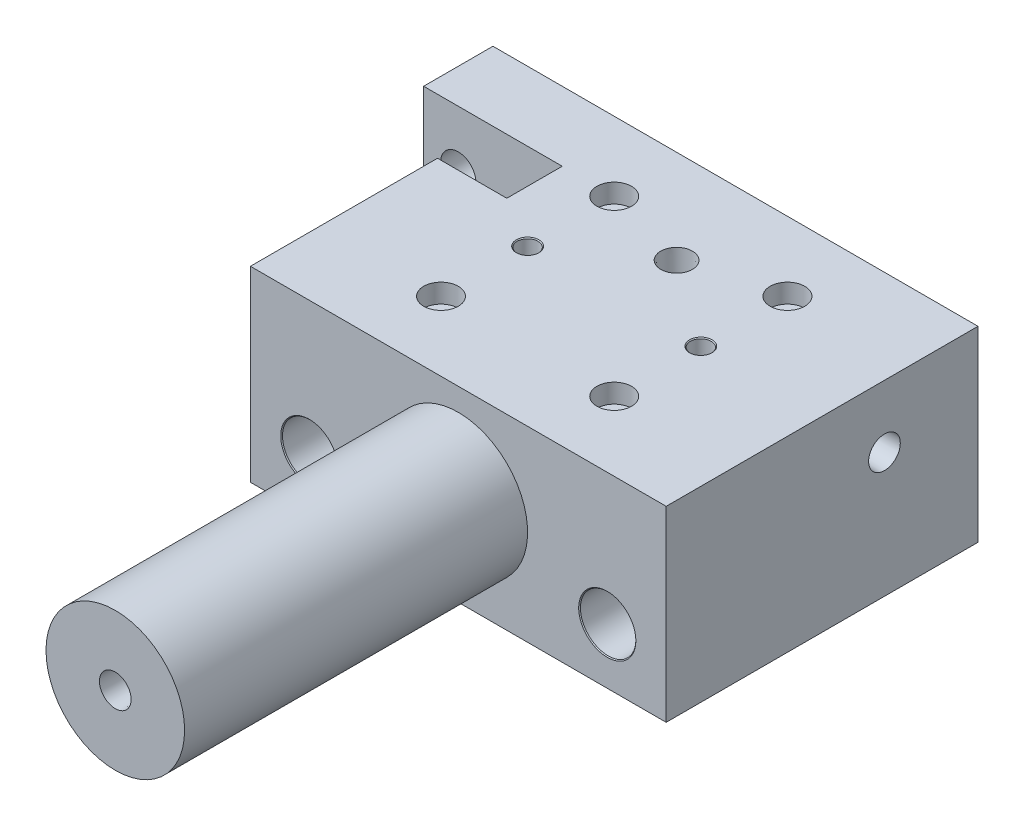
ISO-10303-21;
HEADER;
FILE_DESCRIPTION(('STEP AP214'),'2;1');
FILE_NAME('part.step','',(''),(''),'','','');
FILE_SCHEMA(('AUTOMOTIVE_DESIGN { 1 0 10303 214 1 1 1 1 }'));
ENDSEC;
DATA;
#1=APPLICATION_CONTEXT('core data for automotive mechanical design processes');
#2=APPLICATION_PROTOCOL_DEFINITION('international standard','automotive_design',2000,#1);
#3=PRODUCT_CONTEXT('',#1,'mechanical');
#4=PRODUCT('Part','Part','',(#3));
#5=PRODUCT_RELATED_PRODUCT_CATEGORY('part','',(#4));
#6=PRODUCT_DEFINITION_FORMATION('','',#4);
#7=PRODUCT_DEFINITION_CONTEXT('part definition',#1,'design');
#8=PRODUCT_DEFINITION('design','',#6,#7);
#9=PRODUCT_DEFINITION_SHAPE('','',#8);
#10=(LENGTH_UNIT() NAMED_UNIT(*) SI_UNIT(.MILLI.,.METRE.));
#11=(NAMED_UNIT(*) PLANE_ANGLE_UNIT() SI_UNIT($,.RADIAN.));
#12=(NAMED_UNIT(*) SI_UNIT($,.STERADIAN.) SOLID_ANGLE_UNIT());
#13=UNCERTAINTY_MEASURE_WITH_UNIT(LENGTH_MEASURE(1.E-05),#10,'distance_accuracy_value','');
#14=(GEOMETRIC_REPRESENTATION_CONTEXT(3) GLOBAL_UNCERTAINTY_ASSIGNED_CONTEXT((#13)) GLOBAL_UNIT_ASSIGNED_CONTEXT((#10,
#11,#12)) REPRESENTATION_CONTEXT('',''));
#15=CARTESIAN_POINT('',(0.,0.,0.));
#16=DIRECTION('',(0.,0.,1.));
#17=DIRECTION('',(1.,0.,0.));
#18=AXIS2_PLACEMENT_3D('',#15,#16,#17);
#19=CARTESIAN_POINT('',(0.,4.,-81.));
#20=DIRECTION('',(-1.,0.,0.));
#21=DIRECTION('',(0.,0.,1.));
#22=AXIS2_PLACEMENT_3D('',#19,#20,#21);
#23=CYLINDRICAL_SURFACE('',#22,2.39999999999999);
#24=CARTESIAN_POINT('',(8.99999999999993,4.,-81.));
#25=DIRECTION('',(-1.,0.,0.));
#26=DIRECTION('',(0.,0.,1.));
#27=AXIS2_PLACEMENT_3D('',#24,#25,#26);
#28=CIRCLE('',#27,2.39999999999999);
#29=CARTESIAN_POINT('',(8.99999999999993,4.,-78.6));
#30=VERTEX_POINT('',#29);
#31=EDGE_CURVE('E9355',#30,#30,#28,.T.);
#32=ORIENTED_EDGE('',*,*,#31,.F.);
#33=EDGE_LOOP('',(#32));
#34=FACE_BOUND('',#33,.T.);
#35=CARTESIAN_POINT('',(4.5,4.,-81.));
#36=DIRECTION('',(-1.,0.,0.));
#37=DIRECTION('',(0.,0.,1.));
#38=AXIS2_PLACEMENT_3D('',#35,#36,#37);
#39=CIRCLE('',#38,2.39999999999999);
#40=CARTESIAN_POINT('',(4.5,4.,-78.6));
#41=VERTEX_POINT('',#40);
#42=EDGE_CURVE('E9342',#41,#41,#39,.F.);
#43=ORIENTED_EDGE('',*,*,#42,.F.);
#44=EDGE_LOOP('',(#43));
#45=FACE_BOUND('',#44,.T.);
#46=ADVANCED_FACE('F9174',(#34,#45),#23,.F.);
#47=CARTESIAN_POINT('',(0.,54.,-90.));
#48=DIRECTION('',(1.,0.,0.));
#49=DIRECTION('',(0.,0.,-1.));
#50=AXIS2_PLACEMENT_3D('',#47,#48,#49);
#51=PLANE('',#50);
#52=CARTESIAN_POINT('',(0.,4.,-81.));
#53=DIRECTION('',(-1.,0.,0.));
#54=DIRECTION('',(0.,0.,1.));
#55=AXIS2_PLACEMENT_3D('',#52,#53,#54);
#56=CIRCLE('',#55,4.00000000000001);
#57=CARTESIAN_POINT('',(0.,3.85832158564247,-77.0025098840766));
#58=VERTEX_POINT('',#57);
#59=CARTESIAN_POINT('',(0.,4.,-85.));
#60=VERTEX_POINT('',#59);
#61=EDGE_CURVE('E9321',#58,#60,#56,.T.);
#62=ORIENTED_EDGE('',*,*,#61,.F.);
#63=DIRECTION('',(0.,1.,0.));
#64=VECTOR('',#63,1.);
#65=CARTESIAN_POINT('',(0.,3.85832158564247,-77.0025098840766));
#66=LINE('',#65,#64);
#67=CARTESIAN_POINT('',(0.,0.,-77.0025098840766));
#68=VERTEX_POINT('',#67);
#69=EDGE_CURVE('E9328',#68,#58,#66,.T.);
#70=ORIENTED_EDGE('',*,*,#69,.F.);
#71=DIRECTION('',(0.,0.,1.));
#72=VECTOR('',#71,1.);
#73=CARTESIAN_POINT('',(0.,0.,-90.));
#74=LINE('',#73,#72);
#75=CARTESIAN_POINT('',(0.,0.,-70.));
#76=VERTEX_POINT('',#75);
#77=EDGE_CURVE('E9548',#68,#76,#74,.T.);
#78=ORIENTED_EDGE('',*,*,#77,.T.);
#79=DIRECTION('',(0.,-1.,0.));
#80=VECTOR('',#79,1.);
#81=CARTESIAN_POINT('',(0.,54.,-70.));
#82=LINE('',#81,#80);
#83=CARTESIAN_POINT('',(0.,54.,-70.));
#84=VERTEX_POINT('',#83);
#85=EDGE_CURVE('E9580',#84,#76,#82,.T.);
#86=ORIENTED_EDGE('',*,*,#85,.F.);
#87=DIRECTION('',(0.,0.,1.));
#88=VECTOR('',#87,1.);
#89=CARTESIAN_POINT('',(0.,54.,-90.));
#90=LINE('',#89,#88);
#91=CARTESIAN_POINT('',(0.,54.,-90.));
#92=VERTEX_POINT('',#91);
#93=EDGE_CURVE('E9565',#92,#84,#90,.T.);
#94=ORIENTED_EDGE('',*,*,#93,.F.);
#95=DIRECTION('',(0.,-1.,0.));
#96=VECTOR('',#95,1.);
#97=CARTESIAN_POINT('',(0.,54.,-90.));
#98=LINE('',#97,#96);
#99=CARTESIAN_POINT('',(0.,0.,-90.));
#100=VERTEX_POINT('',#99);
#101=EDGE_CURVE('E9583',#92,#100,#98,.T.);
#102=ORIENTED_EDGE('',*,*,#101,.T.);
#103=CARTESIAN_POINT('',(0.,0.,-85.));
#104=VERTEX_POINT('',#103);
#105=EDGE_CURVE('E9549',#100,#104,#74,.T.);
#106=ORIENTED_EDGE('',*,*,#105,.T.);
#107=DIRECTION('',(0.,-1.,0.));
#108=VECTOR('',#107,1.);
#109=CARTESIAN_POINT('',(0.,4.,-85.));
#110=LINE('',#109,#108);
#111=EDGE_CURVE('E9326',#60,#104,#110,.T.);
#112=ORIENTED_EDGE('',*,*,#111,.F.);
#113=EDGE_LOOP('',(#62,#70,#78,#86,#94,#102,#106,#112));
#114=FACE_BOUND('',#113,.T.);
#115=ADVANCED_FACE('F9645',(#114),#51,.F.);
#116=CARTESIAN_POINT('',(140.,0.,-90.));
#117=DIRECTION('',(0.,-1.,0.));
#118=DIRECTION('',(0.,0.,-1.));
#119=AXIS2_PLACEMENT_3D('',#116,#117,#118);
#120=PLANE('',#119);
#121=DIRECTION('',(-1.,0.,0.));
#122=VECTOR('',#121,1.);
#123=CARTESIAN_POINT('',(4.5,0.,-77.0025098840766));
#124=LINE('',#123,#122);
#125=CARTESIAN_POINT('',(4.5,0.,-77.0025098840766));
#126=VERTEX_POINT('',#125);
#127=EDGE_CURVE('E9343',#126,#68,#124,.T.);
#128=ORIENTED_EDGE('',*,*,#127,.F.);
#129=DIRECTION('',(0.,0.,1.));
#130=VECTOR('',#129,1.);
#131=CARTESIAN_POINT('',(4.5,0.,-85.));
#132=LINE('',#131,#130);
#133=CARTESIAN_POINT('',(4.5,0.,-85.));
#134=VERTEX_POINT('',#133);
#135=EDGE_CURVE('E9334',#134,#126,#132,.T.);
#136=ORIENTED_EDGE('',*,*,#135,.F.);
#137=DIRECTION('',(-1.,0.,0.));
#138=VECTOR('',#137,1.);
#139=CARTESIAN_POINT('',(4.5,0.,-85.));
#140=LINE('',#139,#138);
#141=EDGE_CURVE('E9345',#134,#104,#140,.T.);
#142=ORIENTED_EDGE('',*,*,#141,.T.);
#143=ORIENTED_EDGE('',*,*,#105,.F.);
#144=DIRECTION('',(-1.,0.,0.));
#145=VECTOR('',#144,1.);
#146=CARTESIAN_POINT('',(0.,0.,-90.));
#147=LINE('',#146,#145);
#148=CARTESIAN_POINT('',(8.99999999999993,0.,-90.));
#149=VERTEX_POINT('',#148);
#150=EDGE_CURVE('E9544',#149,#100,#147,.T.);
#151=ORIENTED_EDGE('',*,*,#150,.F.);
#152=DIRECTION('',(0.,0.,-1.));
#153=VECTOR('',#152,1.);
#154=CARTESIAN_POINT('',(8.99999999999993,0.,-69.));
#155=LINE('',#154,#153);
#156=CARTESIAN_POINT('',(8.99999999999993,0.,-70.));
#157=VERTEX_POINT('',#156);
#158=EDGE_CURVE('E9358',#157,#149,#155,.T.);
#159=ORIENTED_EDGE('',*,*,#158,.F.);
#160=DIRECTION('',(1.,0.,0.));
#161=VECTOR('',#160,1.);
#162=CARTESIAN_POINT('',(0.,0.,-70.));
#163=LINE('',#162,#161);
#164=EDGE_CURVE('E9553',#76,#157,#163,.T.);
#165=ORIENTED_EDGE('',*,*,#164,.F.);
#166=ORIENTED_EDGE('',*,*,#77,.F.);
#167=EDGE_LOOP('',(#128,#136,#142,#143,#151,#159,#165,#166));
#168=FACE_BOUND('',#167,.T.);
#169=ADVANCED_FACE('F9652',(#168),#120,.T.);
#170=CARTESIAN_POINT('',(20.,54.,0.));
#171=DIRECTION('',(0.,0.,-1.));
#172=DIRECTION('',(-1.,0.,0.));
#173=AXIS2_PLACEMENT_3D('',#170,#171,#172);
#174=PLANE('',#173);
#175=DIRECTION('',(1.,0.,0.));
#176=VECTOR('',#175,1.);
#177=CARTESIAN_POINT('',(20.,0.,0.));
#178=LINE('',#177,#176);
#179=CARTESIAN_POINT('',(20.,0.,0.));
#180=VERTEX_POINT('',#179);
#181=CARTESIAN_POINT('',(140.,0.,0.));
#182=VERTEX_POINT('',#181);
#183=EDGE_CURVE('E9558',#180,#182,#178,.T.);
#184=ORIENTED_EDGE('',*,*,#183,.T.);
#185=DIRECTION('',(0.,-1.,0.));
#186=VECTOR('',#185,1.);
#187=CARTESIAN_POINT('',(140.,54.,0.));
#188=LINE('',#187,#186);
#189=CARTESIAN_POINT('',(140.,54.,0.));
#190=VERTEX_POINT('',#189);
#191=EDGE_CURVE('E9572',#190,#182,#188,.T.);
#192=ORIENTED_EDGE('',*,*,#191,.F.);
#193=DIRECTION('',(1.,0.,0.));
#194=VECTOR('',#193,1.);
#195=CARTESIAN_POINT('',(20.,54.,0.));
#196=LINE('',#195,#194);
#197=CARTESIAN_POINT('',(20.,54.,0.));
#198=VERTEX_POINT('',#197);
#199=EDGE_CURVE('E9570',#198,#190,#196,.T.);
#200=ORIENTED_EDGE('',*,*,#199,.F.);
#201=DIRECTION('',(0.,-1.,0.));
#202=VECTOR('',#201,1.);
#203=CARTESIAN_POINT('',(20.,54.,0.));
#204=LINE('',#203,#202);
#205=EDGE_CURVE('E9575',#198,#180,#204,.T.);
#206=ORIENTED_EDGE('',*,*,#205,.T.);
#207=EDGE_LOOP('',(#184,#192,#200,#206));
#208=FACE_BOUND('',#207,.T.);
#209=CARTESIAN_POINT('',(37.,16.,0.));
#210=DIRECTION('',(0.,0.,1.));
#211=DIRECTION('',(1.,0.,0.));
#212=AXIS2_PLACEMENT_3D('',#209,#210,#211);
#213=CIRCLE('',#212,8.25);
#214=CARTESIAN_POINT('',(45.25,16.,0.));
#215=VERTEX_POINT('',#214);
#216=EDGE_CURVE('E9526',#215,#215,#213,.T.);
#217=ORIENTED_EDGE('',*,*,#216,.F.);
#218=EDGE_LOOP('',(#217));
#219=FACE_BOUND('',#218,.T.);
#220=CARTESIAN_POINT('',(123.,16.,0.));
#221=DIRECTION('',(0.,0.,1.));
#222=DIRECTION('',(1.,0.,0.));
#223=AXIS2_PLACEMENT_3D('',#220,#221,#222);
#224=CIRCLE('',#223,8.24999999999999);
#225=CARTESIAN_POINT('',(131.25,16.,0.));
#226=VERTEX_POINT('',#225);
#227=EDGE_CURVE('E9514',#226,#226,#224,.T.);
#228=ORIENTED_EDGE('',*,*,#227,.F.);
#229=EDGE_LOOP('',(#228));
#230=FACE_BOUND('',#229,.T.);
#231=CARTESIAN_POINT('',(80.,27.5,0.));
#232=DIRECTION('',(0.,0.,-1.));
#233=DIRECTION('',(-1.,0.,0.));
#234=AXIS2_PLACEMENT_3D('',#231,#232,#233);
#235=CIRCLE('',#234,20.);
#236=CARTESIAN_POINT('',(60.,27.5,0.));
#237=VERTEX_POINT('',#236);
#238=EDGE_CURVE('E9589',#237,#237,#235,.F.);
#239=ORIENTED_EDGE('',*,*,#238,.F.);
#240=EDGE_LOOP('',(#239));
#241=FACE_BOUND('',#240,.T.);
#242=ADVANCED_FACE('F9626',(#208,#219,#230,#241),#174,.F.);
#243=DIRECTION('',(0.,0.,1.));
#244=VECTOR('',#243,1.);
#245=CARTESIAN_POINT('',(10.9999999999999,0.,-69.));
#246=LINE('',#245,#244);
#247=CARTESIAN_POINT('',(10.9999999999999,0.,-90.));
#248=VERTEX_POINT('',#247);
#249=CARTESIAN_POINT('',(10.9999999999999,0.,-70.));
#250=VERTEX_POINT('',#249);
#251=EDGE_CURVE('E9360',#248,#250,#246,.T.);
#252=ORIENTED_EDGE('',*,*,#251,.F.);
#253=CARTESIAN_POINT('',(140.,0.,-90.));
#254=VERTEX_POINT('',#253);
#255=EDGE_CURVE('E9545',#254,#248,#147,.T.);
#256=ORIENTED_EDGE('',*,*,#255,.F.);
#257=DIRECTION('',(0.,0.,-1.));
#258=VECTOR('',#257,1.);
#259=CARTESIAN_POINT('',(140.,0.,0.));
#260=LINE('',#259,#258);
#261=EDGE_CURVE('E9541',#182,#254,#260,.T.);
#262=ORIENTED_EDGE('',*,*,#261,.F.);
#263=ORIENTED_EDGE('',*,*,#183,.F.);
#264=DIRECTION('',(0.,0.,1.));
#265=VECTOR('',#264,1.);
#266=CARTESIAN_POINT('',(19.9999999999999,0.,-70.));
#267=LINE('',#266,#265);
#268=CARTESIAN_POINT('',(19.9999999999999,0.,-70.));
#269=VERTEX_POINT('',#268);
#270=EDGE_CURVE('E9556',#269,#180,#267,.T.);
#271=ORIENTED_EDGE('',*,*,#270,.F.);
#272=EDGE_CURVE('E9552',#250,#269,#163,.T.);
#273=ORIENTED_EDGE('',*,*,#272,.F.);
#274=EDGE_LOOP('',(#252,#256,#262,#263,#271,#273));
#275=FACE_BOUND('',#274,.T.);
#276=CARTESIAN_POINT('',(80.,0.,-63.));
#277=DIRECTION('',(0.,-1.,0.));
#278=DIRECTION('',(0.,0.,-1.));
#279=AXIS2_PLACEMENT_3D('',#276,#277,#278);
#280=CIRCLE('',#279,4.57349999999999);
#281=CARTESIAN_POINT('',(80.,0.,-67.5735));
#282=VERTEX_POINT('',#281);
#283=EDGE_CURVE('E9422',#282,#282,#280,.T.);
#284=ORIENTED_EDGE('',*,*,#283,.F.);
#285=EDGE_LOOP('',(#284));
#286=FACE_BOUND('',#285,.T.);
#287=CARTESIAN_POINT('',(55.,0.,-20.));
#288=DIRECTION('',(0.,-1.,0.));
#289=DIRECTION('',(0.,0.,-1.));
#290=AXIS2_PLACEMENT_3D('',#287,#288,#289);
#291=CIRCLE('',#290,5.);
#292=CARTESIAN_POINT('',(55.,0.,-25.));
#293=VERTEX_POINT('',#292);
#294=EDGE_CURVE('E9425',#293,#293,#291,.T.);
#295=ORIENTED_EDGE('',*,*,#294,.F.);
#296=EDGE_LOOP('',(#295));
#297=FACE_BOUND('',#296,.T.);
#298=CARTESIAN_POINT('',(55.,0.,-70.));
#299=DIRECTION('',(0.,-1.,0.));
#300=DIRECTION('',(0.,0.,-1.));
#301=AXIS2_PLACEMENT_3D('',#298,#299,#300);
#302=CIRCLE('',#301,5.);
#303=CARTESIAN_POINT('',(55.,0.,-75.));
#304=VERTEX_POINT('',#303);
#305=EDGE_CURVE('E9453',#304,#304,#302,.T.);
#306=ORIENTED_EDGE('',*,*,#305,.F.);
#307=EDGE_LOOP('',(#306));
#308=FACE_BOUND('',#307,.T.);
#309=CARTESIAN_POINT('',(105.,0.,-45.));
#310=DIRECTION('',(0.,-1.,0.));
#311=DIRECTION('',(0.,0.,-1.));
#312=AXIS2_PLACEMENT_3D('',#309,#310,#311);
#313=CIRCLE('',#312,3.25);
#314=CARTESIAN_POINT('',(105.,0.,-48.25));
#315=VERTEX_POINT('',#314);
#316=EDGE_CURVE('E9490',#315,#315,#313,.T.);
#317=ORIENTED_EDGE('',*,*,#316,.F.);
#318=EDGE_LOOP('',(#317));
#319=FACE_BOUND('',#318,.T.);
#320=CARTESIAN_POINT('',(55.,0.,-45.));
#321=DIRECTION('',(0.,-1.,0.));
#322=DIRECTION('',(0.,0.,-1.));
#323=AXIS2_PLACEMENT_3D('',#320,#321,#322);
#324=CIRCLE('',#323,3.25);
#325=CARTESIAN_POINT('',(55.,0.,-48.25));
#326=VERTEX_POINT('',#325);
#327=EDGE_CURVE('E9502',#326,#326,#324,.T.);
#328=ORIENTED_EDGE('',*,*,#327,.F.);
#329=EDGE_LOOP('',(#328));
#330=FACE_BOUND('',#329,.T.);
#331=CARTESIAN_POINT('',(105.,0.,-70.));
#332=DIRECTION('',(0.,-1.,0.));
#333=DIRECTION('',(0.,0.,-1.));
#334=AXIS2_PLACEMENT_3D('',#331,#332,#333);
#335=CIRCLE('',#334,5.);
#336=CARTESIAN_POINT('',(105.,0.,-75.));
#337=VERTEX_POINT('',#336);
#338=EDGE_CURVE('E9467',#337,#337,#335,.T.);
#339=ORIENTED_EDGE('',*,*,#338,.F.);
#340=EDGE_LOOP('',(#339));
#341=FACE_BOUND('',#340,.T.);
#342=CARTESIAN_POINT('',(105.,0.,-20.));
#343=DIRECTION('',(0.,-1.,0.));
#344=DIRECTION('',(0.,0.,-1.));
#345=AXIS2_PLACEMENT_3D('',#342,#343,#344);
#346=CIRCLE('',#345,5.);
#347=CARTESIAN_POINT('',(105.,0.,-25.));
#348=VERTEX_POINT('',#347);
#349=EDGE_CURVE('E9439',#348,#348,#346,.T.);
#350=ORIENTED_EDGE('',*,*,#349,.F.);
#351=EDGE_LOOP('',(#350));
#352=FACE_BOUND('',#351,.T.);
#353=ADVANCED_FACE('F9631',(#275,#286,#297,#308,#319,#330,#341,#352),#120,.T.);
#354=CARTESIAN_POINT('',(140.,54.,0.));
#355=DIRECTION('',(-1.,0.,0.));
#356=DIRECTION('',(0.,0.,1.));
#357=AXIS2_PLACEMENT_3D('',#354,#355,#356);
#358=PLANE('',#357);
#359=CARTESIAN_POINT('',(140.,36.,-63.));
#360=DIRECTION('',(1.,0.,0.));
#361=DIRECTION('',(0.,0.,-1.));
#362=AXIS2_PLACEMENT_3D('',#359,#360,#361);
#363=CIRCLE('',#362,4.5735);
#364=CARTESIAN_POINT('',(140.,36.,-67.5735));
#365=VERTEX_POINT('',#364);
#366=EDGE_CURVE('E9398',#365,#365,#363,.T.);
#367=ORIENTED_EDGE('',*,*,#366,.F.);
#368=EDGE_LOOP('',(#367));
#369=FACE_BOUND('',#368,.T.);
#370=ORIENTED_EDGE('',*,*,#261,.T.);
#371=DIRECTION('',(0.,-1.,0.));
#372=VECTOR('',#371,1.);
#373=CARTESIAN_POINT('',(140.,54.,-90.));
#374=LINE('',#373,#372);
#375=CARTESIAN_POINT('',(140.,54.,-90.));
#376=VERTEX_POINT('',#375);
#377=EDGE_CURVE('E9586',#376,#254,#374,.T.);
#378=ORIENTED_EDGE('',*,*,#377,.F.);
#379=DIRECTION('',(0.,0.,-1.));
#380=VECTOR('',#379,1.);
#381=CARTESIAN_POINT('',(140.,54.,0.));
#382=LINE('',#381,#380);
#383=EDGE_CURVE('E9560',#190,#376,#382,.T.);
#384=ORIENTED_EDGE('',*,*,#383,.F.);
#385=ORIENTED_EDGE('',*,*,#191,.T.);
#386=EDGE_LOOP('',(#370,#378,#384,#385));
#387=FACE_BOUND('',#386,.T.);
#388=ADVANCED_FACE('F9176',(#369,#387),#358,.F.);
#389=CARTESIAN_POINT('',(0.,54.,-90.));
#390=DIRECTION('',(0.,0.,1.));
#391=DIRECTION('',(1.,0.,0.));
#392=AXIS2_PLACEMENT_3D('',#389,#390,#391);
#393=PLANE('',#392);
#394=CARTESIAN_POINT('',(123.,16.,-90.));
#395=DIRECTION('',(0.,0.,1.));
#396=DIRECTION('',(1.,0.,0.));
#397=AXIS2_PLACEMENT_3D('',#394,#395,#396);
#398=CIRCLE('',#397,8.24999999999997);
#399=CARTESIAN_POINT('',(131.25,16.,-90.));
#400=VERTEX_POINT('',#399);
#401=EDGE_CURVE('E9505',#400,#400,#398,.T.);
#402=ORIENTED_EDGE('',*,*,#401,.T.);
#403=EDGE_LOOP('',(#402));
#404=FACE_BOUND('',#403,.T.);
#405=CARTESIAN_POINT('',(37.,16.,-90.));
#406=DIRECTION('',(0.,0.,1.));
#407=DIRECTION('',(1.,0.,0.));
#408=AXIS2_PLACEMENT_3D('',#405,#406,#407);
#409=CIRCLE('',#408,8.24999999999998);
#410=CARTESIAN_POINT('',(45.25,16.,-90.));
#411=VERTEX_POINT('',#410);
#412=EDGE_CURVE('E9517',#411,#411,#409,.T.);
#413=ORIENTED_EDGE('',*,*,#412,.T.);
#414=EDGE_LOOP('',(#413));
#415=FACE_BOUND('',#414,.T.);
#416=CARTESIAN_POINT('',(9.99999999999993,37.5,-90.));
#417=DIRECTION('',(0.,0.,1.));
#418=DIRECTION('',(1.,0.,0.));
#419=AXIS2_PLACEMENT_3D('',#416,#417,#418);
#420=CIRCLE('',#419,5.1);
#421=CARTESIAN_POINT('',(15.0999999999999,37.5,-90.));
#422=VERTEX_POINT('',#421);
#423=EDGE_CURVE('E9529',#422,#422,#420,.T.);
#424=ORIENTED_EDGE('',*,*,#423,.T.);
#425=EDGE_LOOP('',(#424));
#426=FACE_BOUND('',#425,.T.);
#427=CARTESIAN_POINT('',(9.99999999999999,13.5,-90.));
#428=DIRECTION('',(0.,0.,1.));
#429=DIRECTION('',(1.,0.,0.));
#430=AXIS2_PLACEMENT_3D('',#427,#428,#429);
#431=CIRCLE('',#430,6.);
#432=CARTESIAN_POINT('',(10.9999999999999,7.58392021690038,-90.));
#433=VERTEX_POINT('',#432);
#434=CARTESIAN_POINT('',(8.99999999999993,7.5839202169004,-90.));
#435=VERTEX_POINT('',#434);
#436=EDGE_CURVE('E9535',#433,#435,#431,.T.);
#437=ORIENTED_EDGE('',*,*,#436,.T.);
#438=DIRECTION('',(0.,-1.,0.));
#439=VECTOR('',#438,1.);
#440=CARTESIAN_POINT('',(8.99999999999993,54.,-90.));
#441=LINE('',#440,#439);
#442=EDGE_CURVE('E9371',#435,#149,#441,.T.);
#443=ORIENTED_EDGE('',*,*,#442,.T.);
#444=ORIENTED_EDGE('',*,*,#150,.T.);
#445=ORIENTED_EDGE('',*,*,#101,.F.);
#446=DIRECTION('',(-1.,0.,0.));
#447=VECTOR('',#446,1.);
#448=CARTESIAN_POINT('',(0.,54.,-90.));
#449=LINE('',#448,#447);
#450=EDGE_CURVE('E9563',#376,#92,#449,.T.);
#451=ORIENTED_EDGE('',*,*,#450,.F.);
#452=ORIENTED_EDGE('',*,*,#377,.T.);
#453=ORIENTED_EDGE('',*,*,#255,.T.);
#454=DIRECTION('',(0.,1.,0.));
#455=VECTOR('',#454,1.);
#456=CARTESIAN_POINT('',(10.9999999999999,54.,-90.));
#457=LINE('',#456,#455);
#458=EDGE_CURVE('E9365',#248,#433,#457,.T.);
#459=ORIENTED_EDGE('',*,*,#458,.T.);
#460=EDGE_LOOP('',(#437,#443,#444,#445,#451,#452,#453,#459));
#461=FACE_BOUND('',#460,.T.);
#462=ADVANCED_FACE('F9640',(#404,#415,#426,#461),#393,.F.);
#463=CARTESIAN_POINT('',(0.,54.,-70.));
#464=DIRECTION('',(0.,0.,-1.));
#465=DIRECTION('',(-1.,0.,0.));
#466=AXIS2_PLACEMENT_3D('',#463,#464,#465);
#467=PLANE('',#466);
#468=CARTESIAN_POINT('',(9.99999999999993,37.5,-70.));
#469=DIRECTION('',(0.,0.,1.));
#470=DIRECTION('',(1.,0.,0.));
#471=AXIS2_PLACEMENT_3D('',#468,#469,#470);
#472=CIRCLE('',#471,5.1);
#473=CARTESIAN_POINT('',(15.0999999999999,37.5,-70.));
#474=VERTEX_POINT('',#473);
#475=EDGE_CURVE('E9532',#474,#474,#472,.T.);
#476=ORIENTED_EDGE('',*,*,#475,.F.);
#477=EDGE_LOOP('',(#476));
#478=FACE_BOUND('',#477,.T.);
#479=DIRECTION('',(0.,-1.,0.));
#480=VECTOR('',#479,1.);
#481=CARTESIAN_POINT('',(19.9999999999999,54.,-70.));
#482=LINE('',#481,#480);
#483=CARTESIAN_POINT('',(19.9999999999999,34.,-70.));
#484=VERTEX_POINT('',#483);
#485=EDGE_CURVE('E9578',#484,#269,#482,.T.);
#486=ORIENTED_EDGE('',*,*,#485,.F.);
#487=DIRECTION('',(-0.707106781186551,-0.707106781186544,0.));
#488=VECTOR('',#487,1.);
#489=CARTESIAN_POINT('',(19.9999999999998,34.,-70.));
#490=LINE('',#489,#488);
#491=CARTESIAN_POINT('',(39.9999999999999,54.,-70.));
#492=VERTEX_POINT('',#491);
#493=EDGE_CURVE('E9182',#484,#492,#490,.F.);
#494=ORIENTED_EDGE('',*,*,#493,.T.);
#495=DIRECTION('',(1.,0.,0.));
#496=VECTOR('',#495,1.);
#497=CARTESIAN_POINT('',(0.,54.,-70.));
#498=LINE('',#497,#496);
#499=EDGE_CURVE('E9311',#84,#492,#498,.T.);
#500=ORIENTED_EDGE('',*,*,#499,.F.);
#501=ORIENTED_EDGE('',*,*,#85,.T.);
#502=ORIENTED_EDGE('',*,*,#164,.T.);
#503=DIRECTION('',(0.,1.,0.));
#504=VECTOR('',#503,1.);
#505=CARTESIAN_POINT('',(8.99999999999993,54.,-70.));
#506=LINE('',#505,#504);
#507=CARTESIAN_POINT('',(8.99999999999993,7.5839202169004,-70.));
#508=VERTEX_POINT('',#507);
#509=EDGE_CURVE('E9368',#157,#508,#506,.T.);
#510=ORIENTED_EDGE('',*,*,#509,.T.);
#511=CARTESIAN_POINT('',(9.99999999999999,13.5,-70.));
#512=DIRECTION('',(0.,0.,1.));
#513=DIRECTION('',(1.,0.,0.));
#514=AXIS2_PLACEMENT_3D('',#511,#512,#513);
#515=CIRCLE('',#514,6.);
#516=CARTESIAN_POINT('',(10.9999999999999,7.58392021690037,-70.));
#517=VERTEX_POINT('',#516);
#518=EDGE_CURVE('E9538',#517,#508,#515,.T.);
#519=ORIENTED_EDGE('',*,*,#518,.F.);
#520=DIRECTION('',(0.,-1.,0.));
#521=VECTOR('',#520,1.);
#522=CARTESIAN_POINT('',(10.9999999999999,54.,-70.));
#523=LINE('',#522,#521);
#524=EDGE_CURVE('E9362',#517,#250,#523,.T.);
#525=ORIENTED_EDGE('',*,*,#524,.T.);
#526=ORIENTED_EDGE('',*,*,#272,.T.);
#527=EDGE_LOOP('',(#486,#494,#500,#501,#502,#510,#519,#525,#526));
#528=FACE_BOUND('',#527,.T.);
#529=ADVANCED_FACE('F9616',(#478,#528),#467,.F.);
#530=CARTESIAN_POINT('',(19.9999999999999,54.,-70.));
#531=DIRECTION('',(1.,0.,0.));
#532=DIRECTION('',(0.,0.,-1.));
#533=AXIS2_PLACEMENT_3D('',#530,#531,#532);
#534=PLANE('',#533);
#535=DIRECTION('',(0.,0.,1.));
#536=VECTOR('',#535,1.);
#537=CARTESIAN_POINT('',(19.9999999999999,54.,-70.));
#538=LINE('',#537,#536);
#539=CARTESIAN_POINT('',(19.9999999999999,54.,-54.));
#540=VERTEX_POINT('',#539);
#541=EDGE_CURVE('E9568',#540,#198,#538,.T.);
#542=ORIENTED_EDGE('',*,*,#541,.F.);
#543=DIRECTION('',(0.,1.,0.));
#544=VECTOR('',#543,1.);
#545=CARTESIAN_POINT('',(19.9999999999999,34.,-54.));
#546=LINE('',#545,#544);
#547=CARTESIAN_POINT('',(19.9999999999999,34.,-54.));
#548=VERTEX_POINT('',#547);
#549=EDGE_CURVE('E9188',#548,#540,#546,.T.);
#550=ORIENTED_EDGE('',*,*,#549,.F.);
#551=DIRECTION('',(0.,0.,1.));
#552=VECTOR('',#551,1.);
#553=CARTESIAN_POINT('',(19.9999999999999,34.,-54.));
#554=LINE('',#553,#552);
#555=EDGE_CURVE('E9313',#484,#548,#554,.T.);
#556=ORIENTED_EDGE('',*,*,#555,.F.);
#557=ORIENTED_EDGE('',*,*,#485,.T.);
#558=ORIENTED_EDGE('',*,*,#270,.T.);
#559=ORIENTED_EDGE('',*,*,#205,.F.);
#560=EDGE_LOOP('',(#542,#550,#556,#557,#558,#559));
#561=FACE_BOUND('',#560,.T.);
#562=ADVANCED_FACE('F9620',(#561),#534,.F.);
#563=CARTESIAN_POINT('',(140.,54.,-90.));
#564=DIRECTION('',(0.,-1.,0.));
#565=DIRECTION('',(0.,0.,-1.));
#566=AXIS2_PLACEMENT_3D('',#563,#564,#565);
#567=PLANE('',#566);
#568=CARTESIAN_POINT('',(80.,54.,-63.));
#569=DIRECTION('',(0.,1.,0.));
#570=DIRECTION('',(0.,0.,1.));
#571=AXIS2_PLACEMENT_3D('',#568,#569,#570);
#572=CIRCLE('',#571,4.57349999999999);
#573=CARTESIAN_POINT('',(80.,54.,-58.4265));
#574=VERTEX_POINT('',#573);
#575=EDGE_CURVE('E9401',#574,#574,#572,.T.);
#576=ORIENTED_EDGE('',*,*,#575,.F.);
#577=EDGE_LOOP('',(#576));
#578=FACE_BOUND('',#577,.T.);
#579=CARTESIAN_POINT('',(55.,54.,-20.));
#580=DIRECTION('',(0.,1.,0.));
#581=DIRECTION('',(0.,0.,1.));
#582=AXIS2_PLACEMENT_3D('',#579,#580,#581);
#583=CIRCLE('',#582,5.);
#584=CARTESIAN_POINT('',(55.,54.,-15.));
#585=VERTEX_POINT('',#584);
#586=EDGE_CURVE('E9432',#585,#585,#583,.T.);
#587=ORIENTED_EDGE('',*,*,#586,.F.);
#588=EDGE_LOOP('',(#587));
#589=FACE_BOUND('',#588,.T.);
#590=CARTESIAN_POINT('',(105.,54.,-20.));
#591=DIRECTION('',(0.,1.,0.));
#592=DIRECTION('',(0.,0.,1.));
#593=AXIS2_PLACEMENT_3D('',#590,#591,#592);
#594=CIRCLE('',#593,5.);
#595=CARTESIAN_POINT('',(105.,54.,-15.));
#596=VERTEX_POINT('',#595);
#597=EDGE_CURVE('E9446',#596,#596,#594,.T.);
#598=ORIENTED_EDGE('',*,*,#597,.F.);
#599=EDGE_LOOP('',(#598));
#600=FACE_BOUND('',#599,.T.);
#601=CARTESIAN_POINT('',(55.,54.,-70.));
#602=DIRECTION('',(0.,1.,0.));
#603=DIRECTION('',(0.,0.,1.));
#604=AXIS2_PLACEMENT_3D('',#601,#602,#603);
#605=CIRCLE('',#604,5.);
#606=CARTESIAN_POINT('',(55.,54.,-65.));
#607=VERTEX_POINT('',#606);
#608=EDGE_CURVE('E9460',#607,#607,#605,.T.);
#609=ORIENTED_EDGE('',*,*,#608,.F.);
#610=EDGE_LOOP('',(#609));
#611=FACE_BOUND('',#610,.T.);
#612=CARTESIAN_POINT('',(105.,54.,-70.));
#613=DIRECTION('',(0.,1.,0.));
#614=DIRECTION('',(0.,0.,1.));
#615=AXIS2_PLACEMENT_3D('',#612,#613,#614);
#616=CIRCLE('',#615,5.);
#617=CARTESIAN_POINT('',(105.,54.,-65.));
#618=VERTEX_POINT('',#617);
#619=EDGE_CURVE('E9477',#618,#618,#616,.T.);
#620=ORIENTED_EDGE('',*,*,#619,.F.);
#621=EDGE_LOOP('',(#620));
#622=FACE_BOUND('',#621,.T.);
#623=CARTESIAN_POINT('',(105.,54.,-45.));
#624=DIRECTION('',(0.,-1.,0.));
#625=DIRECTION('',(0.,0.,-1.));
#626=AXIS2_PLACEMENT_3D('',#623,#624,#625);
#627=CIRCLE('',#626,3.24999999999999);
#628=CARTESIAN_POINT('',(105.,54.,-48.25));
#629=VERTEX_POINT('',#628);
#630=EDGE_CURVE('E9481',#629,#629,#627,.T.);
#631=ORIENTED_EDGE('',*,*,#630,.T.);
#632=EDGE_LOOP('',(#631));
#633=FACE_BOUND('',#632,.T.);
#634=CARTESIAN_POINT('',(55.,54.,-45.));
#635=DIRECTION('',(0.,-1.,0.));
#636=DIRECTION('',(0.,0.,-1.));
#637=AXIS2_PLACEMENT_3D('',#634,#635,#636);
#638=CIRCLE('',#637,3.24999999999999);
#639=CARTESIAN_POINT('',(55.,54.,-48.25));
#640=VERTEX_POINT('',#639);
#641=EDGE_CURVE('E9493',#640,#640,#638,.T.);
#642=ORIENTED_EDGE('',*,*,#641,.T.);
#643=EDGE_LOOP('',(#642));
#644=FACE_BOUND('',#643,.T.);
#645=ORIENTED_EDGE('',*,*,#499,.T.);
#646=DIRECTION('',(0.,0.,-1.));
#647=VECTOR('',#646,1.);
#648=CARTESIAN_POINT('',(39.9999999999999,54.,-70.));
#649=LINE('',#648,#647);
#650=CARTESIAN_POINT('',(39.9999999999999,54.,-54.));
#651=VERTEX_POINT('',#650);
#652=EDGE_CURVE('E9305',#651,#492,#649,.T.);
#653=ORIENTED_EDGE('',*,*,#652,.F.);
#654=DIRECTION('',(1.,0.,0.));
#655=VECTOR('',#654,1.);
#656=CARTESIAN_POINT('',(39.9999999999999,54.,-54.));
#657=LINE('',#656,#655);
#658=EDGE_CURVE('E9299',#540,#651,#657,.T.);
#659=ORIENTED_EDGE('',*,*,#658,.F.);
#660=ORIENTED_EDGE('',*,*,#541,.T.);
#661=ORIENTED_EDGE('',*,*,#199,.T.);
#662=ORIENTED_EDGE('',*,*,#383,.T.);
#663=ORIENTED_EDGE('',*,*,#450,.T.);
#664=ORIENTED_EDGE('',*,*,#93,.T.);
#665=EDGE_LOOP('',(#645,#653,#659,#660,#661,#662,#663,#664));
#666=FACE_BOUND('',#665,.T.);
#667=ADVANCED_FACE('F9309',(#578,#589,#600,#611,#622,#633,#644,#666),#567,.F.);
#668=CARTESIAN_POINT('',(9.99999999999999,13.5,-70.));
#669=DIRECTION('',(0.,0.,1.));
#670=DIRECTION('',(1.,0.,0.));
#671=AXIS2_PLACEMENT_3D('',#668,#669,#670);
#672=CYLINDRICAL_SURFACE('',#671,6.);
#673=ORIENTED_EDGE('',*,*,#518,.T.);
#674=DIRECTION('',(0.,0.,1.));
#675=VECTOR('',#674,1.);
#676=CARTESIAN_POINT('',(8.99999999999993,7.5839202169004,-70.));
#677=LINE('',#676,#675);
#678=EDGE_CURVE('E9611',#508,#435,#677,.F.);
#679=ORIENTED_EDGE('',*,*,#678,.T.);
#680=ORIENTED_EDGE('',*,*,#436,.F.);
#681=DIRECTION('',(0.,0.,1.));
#682=VECTOR('',#681,1.);
#683=CARTESIAN_POINT('',(10.9999999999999,7.58392021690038,-70.));
#684=LINE('',#683,#682);
#685=EDGE_CURVE('E9608',#433,#517,#684,.T.);
#686=ORIENTED_EDGE('',*,*,#685,.T.);
#687=EDGE_LOOP('',(#673,#679,#680,#686));
#688=FACE_BOUND('',#687,.T.);
#689=ADVANCED_FACE('F9657',(#688),#672,.F.);
#690=CARTESIAN_POINT('',(9.99999999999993,37.5,-70.));
#691=DIRECTION('',(0.,0.,1.));
#692=DIRECTION('',(1.,0.,0.));
#693=AXIS2_PLACEMENT_3D('',#690,#691,#692);
#694=CYLINDRICAL_SURFACE('',#693,5.1);
#695=ORIENTED_EDGE('',*,*,#423,.F.);
#696=EDGE_LOOP('',(#695));
#697=FACE_BOUND('',#696,.T.);
#698=ORIENTED_EDGE('',*,*,#475,.T.);
#699=EDGE_LOOP('',(#698));
#700=FACE_BOUND('',#699,.T.);
#701=ADVANCED_FACE('F9789',(#697,#700),#694,.F.);
#702=CARTESIAN_POINT('',(37.,16.,0.));
#703=DIRECTION('',(0.,0.,1.));
#704=DIRECTION('',(1.,0.,0.));
#705=AXIS2_PLACEMENT_3D('',#702,#703,#704);
#706=CONICAL_SURFACE('',#705,8.25,0.785398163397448);
#707=CARTESIAN_POINT('',(37.,16.,-0.250000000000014));
#708=DIRECTION('',(0.,0.,1.));
#709=DIRECTION('',(1.,0.,0.));
#710=AXIS2_PLACEMENT_3D('',#707,#708,#709);
#711=CIRCLE('',#710,7.99999999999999);
#712=CARTESIAN_POINT('',(45.,16.,-0.250000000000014));
#713=VERTEX_POINT('',#712);
#714=EDGE_CURVE('E9523',#713,#713,#711,.T.);
#715=ORIENTED_EDGE('',*,*,#714,.F.);
#716=EDGE_LOOP('',(#715));
#717=FACE_BOUND('',#716,.T.);
#718=ORIENTED_EDGE('',*,*,#216,.T.);
#719=EDGE_LOOP('',(#718));
#720=FACE_BOUND('',#719,.T.);
#721=ADVANCED_FACE('F10199',(#717,#720),#706,.F.);
#722=CARTESIAN_POINT('',(37.,16.,0.));
#723=DIRECTION('',(0.,0.,1.));
#724=DIRECTION('',(1.,0.,0.));
#725=AXIS2_PLACEMENT_3D('',#722,#723,#724);
#726=CYLINDRICAL_SURFACE('',#725,7.99999999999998);
#727=CARTESIAN_POINT('',(37.,16.,-89.75));
#728=DIRECTION('',(0.,0.,1.));
#729=DIRECTION('',(1.,0.,0.));
#730=AXIS2_PLACEMENT_3D('',#727,#728,#729);
#731=CIRCLE('',#730,7.99999999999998);
#732=CARTESIAN_POINT('',(45.,16.,-89.75));
#733=VERTEX_POINT('',#732);
#734=EDGE_CURVE('E9520',#733,#733,#731,.T.);
#735=ORIENTED_EDGE('',*,*,#734,.F.);
#736=EDGE_LOOP('',(#735));
#737=FACE_BOUND('',#736,.T.);
#738=ORIENTED_EDGE('',*,*,#714,.T.);
#739=EDGE_LOOP('',(#738));
#740=FACE_BOUND('',#739,.T.);
#741=ADVANCED_FACE('F10191',(#737,#740),#726,.F.);
#742=CARTESIAN_POINT('',(37.,16.,-89.75));
#743=DIRECTION('',(0.,0.,-1.));
#744=DIRECTION('',(-1.,0.,0.));
#745=AXIS2_PLACEMENT_3D('',#742,#743,#744);
#746=CONICAL_SURFACE('',#745,7.99999999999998,0.785398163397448);
#747=ORIENTED_EDGE('',*,*,#412,.F.);
#748=EDGE_LOOP('',(#747));
#749=FACE_BOUND('',#748,.T.);
#750=ORIENTED_EDGE('',*,*,#734,.T.);
#751=EDGE_LOOP('',(#750));
#752=FACE_BOUND('',#751,.T.);
#753=ADVANCED_FACE('F10183',(#749,#752),#746,.F.);
#754=CARTESIAN_POINT('',(123.,16.,0.));
#755=DIRECTION('',(0.,0.,1.));
#756=DIRECTION('',(1.,0.,0.));
#757=AXIS2_PLACEMENT_3D('',#754,#755,#756);
#758=CONICAL_SURFACE('',#757,8.24999999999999,0.785398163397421);
#759=CARTESIAN_POINT('',(123.,16.,-0.250000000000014));
#760=DIRECTION('',(0.,0.,1.));
#761=DIRECTION('',(1.,0.,0.));
#762=AXIS2_PLACEMENT_3D('',#759,#760,#761);
#763=CIRCLE('',#762,7.99999999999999);
#764=CARTESIAN_POINT('',(131.,16.,-0.250000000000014));
#765=VERTEX_POINT('',#764);
#766=EDGE_CURVE('E9511',#765,#765,#763,.T.);
#767=ORIENTED_EDGE('',*,*,#766,.F.);
#768=EDGE_LOOP('',(#767));
#769=FACE_BOUND('',#768,.T.);
#770=ORIENTED_EDGE('',*,*,#227,.T.);
#771=EDGE_LOOP('',(#770));
#772=FACE_BOUND('',#771,.T.);
#773=ADVANCED_FACE('F10175',(#769,#772),#758,.F.);
#774=CARTESIAN_POINT('',(123.,16.,0.));
#775=DIRECTION('',(0.,0.,1.));
#776=DIRECTION('',(1.,0.,0.));
#777=AXIS2_PLACEMENT_3D('',#774,#775,#776);
#778=CYLINDRICAL_SURFACE('',#777,7.99999999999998);
#779=CARTESIAN_POINT('',(123.,16.,-89.75));
#780=DIRECTION('',(0.,0.,1.));
#781=DIRECTION('',(1.,0.,0.));
#782=AXIS2_PLACEMENT_3D('',#779,#780,#781);
#783=CIRCLE('',#782,7.99999999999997);
#784=CARTESIAN_POINT('',(131.,16.,-89.75));
#785=VERTEX_POINT('',#784);
#786=EDGE_CURVE('E9508',#785,#785,#783,.T.);
#787=ORIENTED_EDGE('',*,*,#786,.F.);
#788=EDGE_LOOP('',(#787));
#789=FACE_BOUND('',#788,.T.);
#790=ORIENTED_EDGE('',*,*,#766,.T.);
#791=EDGE_LOOP('',(#790));
#792=FACE_BOUND('',#791,.T.);
#793=ADVANCED_FACE('F10167',(#789,#792),#778,.F.);
#794=CARTESIAN_POINT('',(123.,16.,-89.75));
#795=DIRECTION('',(0.,0.,-1.));
#796=DIRECTION('',(-1.,0.,0.));
#797=AXIS2_PLACEMENT_3D('',#794,#795,#796);
#798=CONICAL_SURFACE('',#797,7.99999999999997,0.785398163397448);
#799=ORIENTED_EDGE('',*,*,#401,.F.);
#800=EDGE_LOOP('',(#799));
#801=FACE_BOUND('',#800,.T.);
#802=ORIENTED_EDGE('',*,*,#786,.T.);
#803=EDGE_LOOP('',(#802));
#804=FACE_BOUND('',#803,.T.);
#805=ADVANCED_FACE('F10159',(#801,#804),#798,.F.);
#806=CARTESIAN_POINT('',(55.,0.,-45.));
#807=DIRECTION('',(0.,-1.,0.));
#808=DIRECTION('',(0.,0.,-1.));
#809=AXIS2_PLACEMENT_3D('',#806,#807,#808);
#810=CONICAL_SURFACE('',#809,3.25,0.785398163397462);
#811=CARTESIAN_POINT('',(55.,0.25,-45.));
#812=DIRECTION('',(0.,-1.,0.));
#813=DIRECTION('',(0.,0.,-1.));
#814=AXIS2_PLACEMENT_3D('',#811,#812,#813);
#815=CIRCLE('',#814,3.);
#816=CARTESIAN_POINT('',(55.,0.25,-48.));
#817=VERTEX_POINT('',#816);
#818=EDGE_CURVE('E9499',#817,#817,#815,.T.);
#819=ORIENTED_EDGE('',*,*,#818,.F.);
#820=EDGE_LOOP('',(#819));
#821=FACE_BOUND('',#820,.T.);
#822=ORIENTED_EDGE('',*,*,#327,.T.);
#823=EDGE_LOOP('',(#822));
#824=FACE_BOUND('',#823,.T.);
#825=ADVANCED_FACE('F10151',(#821,#824),#810,.F.);
#826=CARTESIAN_POINT('',(55.,0.,-45.));
#827=DIRECTION('',(0.,-1.,0.));
#828=DIRECTION('',(0.,0.,-1.));
#829=AXIS2_PLACEMENT_3D('',#826,#827,#828);
#830=CYLINDRICAL_SURFACE('',#829,2.99999999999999);
#831=CARTESIAN_POINT('',(55.,53.75,-45.));
#832=DIRECTION('',(0.,-1.,0.));
#833=DIRECTION('',(0.,0.,-1.));
#834=AXIS2_PLACEMENT_3D('',#831,#832,#833);
#835=CIRCLE('',#834,2.99999999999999);
#836=CARTESIAN_POINT('',(55.,53.75,-48.));
#837=VERTEX_POINT('',#836);
#838=EDGE_CURVE('E9496',#837,#837,#835,.T.);
#839=ORIENTED_EDGE('',*,*,#838,.F.);
#840=EDGE_LOOP('',(#839));
#841=FACE_BOUND('',#840,.T.);
#842=ORIENTED_EDGE('',*,*,#818,.T.);
#843=EDGE_LOOP('',(#842));
#844=FACE_BOUND('',#843,.T.);
#845=ADVANCED_FACE('F10143',(#841,#844),#830,.F.);
#846=CARTESIAN_POINT('',(55.,53.75,-45.));
#847=DIRECTION('',(0.,1.,0.));
#848=DIRECTION('',(0.,0.,1.));
#849=AXIS2_PLACEMENT_3D('',#846,#847,#848);
#850=CONICAL_SURFACE('',#849,2.99999999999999,0.785398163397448);
#851=ORIENTED_EDGE('',*,*,#641,.F.);
#852=EDGE_LOOP('',(#851));
#853=FACE_BOUND('',#852,.T.);
#854=ORIENTED_EDGE('',*,*,#838,.T.);
#855=EDGE_LOOP('',(#854));
#856=FACE_BOUND('',#855,.T.);
#857=ADVANCED_FACE('F10135',(#853,#856),#850,.F.);
#858=CARTESIAN_POINT('',(105.,0.,-45.));
#859=DIRECTION('',(0.,-1.,0.));
#860=DIRECTION('',(0.,0.,-1.));
#861=AXIS2_PLACEMENT_3D('',#858,#859,#860);
#862=CONICAL_SURFACE('',#861,3.25,0.785398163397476);
#863=CARTESIAN_POINT('',(105.,0.25,-45.));
#864=DIRECTION('',(0.,-1.,0.));
#865=DIRECTION('',(0.,0.,-1.));
#866=AXIS2_PLACEMENT_3D('',#863,#864,#865);
#867=CIRCLE('',#866,2.99999999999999);
#868=CARTESIAN_POINT('',(105.,0.25,-48.));
#869=VERTEX_POINT('',#868);
#870=EDGE_CURVE('E9487',#869,#869,#867,.T.);
#871=ORIENTED_EDGE('',*,*,#870,.F.);
#872=EDGE_LOOP('',(#871));
#873=FACE_BOUND('',#872,.T.);
#874=ORIENTED_EDGE('',*,*,#316,.T.);
#875=EDGE_LOOP('',(#874));
#876=FACE_BOUND('',#875,.T.);
#877=ADVANCED_FACE('F10127',(#873,#876),#862,.F.);
#878=CARTESIAN_POINT('',(105.,0.,-45.));
#879=DIRECTION('',(0.,-1.,0.));
#880=DIRECTION('',(0.,0.,-1.));
#881=AXIS2_PLACEMENT_3D('',#878,#879,#880);
#882=CYLINDRICAL_SURFACE('',#881,2.99999999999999);
#883=CARTESIAN_POINT('',(105.,53.75,-45.));
#884=DIRECTION('',(0.,-1.,0.));
#885=DIRECTION('',(0.,0.,-1.));
#886=AXIS2_PLACEMENT_3D('',#883,#884,#885);
#887=CIRCLE('',#886,2.99999999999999);
#888=CARTESIAN_POINT('',(105.,53.75,-48.));
#889=VERTEX_POINT('',#888);
#890=EDGE_CURVE('E9484',#889,#889,#887,.T.);
#891=ORIENTED_EDGE('',*,*,#890,.F.);
#892=EDGE_LOOP('',(#891));
#893=FACE_BOUND('',#892,.T.);
#894=ORIENTED_EDGE('',*,*,#870,.T.);
#895=EDGE_LOOP('',(#894));
#896=FACE_BOUND('',#895,.T.);
#897=ADVANCED_FACE('F10119',(#893,#896),#882,.F.);
#898=CARTESIAN_POINT('',(105.,53.75,-45.));
#899=DIRECTION('',(0.,1.,0.));
#900=DIRECTION('',(0.,0.,1.));
#901=AXIS2_PLACEMENT_3D('',#898,#899,#900);
#902=CONICAL_SURFACE('',#901,2.99999999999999,0.785398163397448);
#903=ORIENTED_EDGE('',*,*,#630,.F.);
#904=EDGE_LOOP('',(#903));
#905=FACE_BOUND('',#904,.T.);
#906=ORIENTED_EDGE('',*,*,#890,.T.);
#907=EDGE_LOOP('',(#906));
#908=FACE_BOUND('',#907,.T.);
#909=ADVANCED_FACE('F10098',(#905,#908),#902,.F.);
#910=CARTESIAN_POINT('',(105.,54.,-70.));
#911=DIRECTION('',(0.,1.,0.));
#912=DIRECTION('',(0.,0.,1.));
#913=AXIS2_PLACEMENT_3D('',#910,#911,#912);
#914=CYLINDRICAL_SURFACE('',#913,2.49999999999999);
#915=CARTESIAN_POINT('',(105.,5.50000000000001,-70.));
#916=DIRECTION('',(0.,1.,0.));
#917=DIRECTION('',(0.,0.,1.));
#918=AXIS2_PLACEMENT_3D('',#915,#916,#917);
#919=CIRCLE('',#918,2.49999999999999);
#920=CARTESIAN_POINT('',(105.,5.50000000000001,-67.5));
#921=VERTEX_POINT('',#920);
#922=EDGE_CURVE('E9473',#921,#921,#919,.F.);
#923=ORIENTED_EDGE('',*,*,#922,.T.);
#924=EDGE_LOOP('',(#923));
#925=FACE_BOUND('',#924,.T.);
#926=CARTESIAN_POINT('',(105.,48.5,-70.));
#927=DIRECTION('',(0.,-1.,0.));
#928=DIRECTION('',(0.,0.,-1.));
#929=AXIS2_PLACEMENT_3D('',#926,#927,#928);
#930=CIRCLE('',#929,2.49999999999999);
#931=CARTESIAN_POINT('',(105.,48.5,-72.5));
#932=VERTEX_POINT('',#931);
#933=EDGE_CURVE('E9480',#932,#932,#930,.F.);
#934=ORIENTED_EDGE('',*,*,#933,.T.);
#935=EDGE_LOOP('',(#934));
#936=FACE_BOUND('',#935,.T.);
#937=ADVANCED_FACE('F10093',(#925,#936),#914,.F.);
#938=CARTESIAN_POINT('',(105.,48.5,-70.));
#939=DIRECTION('',(0.,-1.,0.));
#940=DIRECTION('',(0.,0.,-1.));
#941=AXIS2_PLACEMENT_3D('',#938,#939,#940);
#942=PLANE('',#941);
#943=CARTESIAN_POINT('',(105.,48.5,-70.));
#944=DIRECTION('',(0.,1.,0.));
#945=DIRECTION('',(0.,0.,1.));
#946=AXIS2_PLACEMENT_3D('',#943,#944,#945);
#947=CIRCLE('',#946,5.);
#948=CARTESIAN_POINT('',(105.,48.5,-65.));
#949=VERTEX_POINT('',#948);
#950=EDGE_CURVE('E9474',#949,#949,#947,.T.);
#951=ORIENTED_EDGE('',*,*,#950,.T.);
#952=EDGE_LOOP('',(#951));
#953=FACE_BOUND('',#952,.T.);
#954=ORIENTED_EDGE('',*,*,#933,.F.);
#955=EDGE_LOOP('',(#954));
#956=FACE_BOUND('',#955,.T.);
#957=ADVANCED_FACE('F10097',(#953,#956),#942,.F.);
#958=CARTESIAN_POINT('',(105.,54.,-70.));
#959=DIRECTION('',(0.,1.,0.));
#960=DIRECTION('',(0.,0.,1.));
#961=AXIS2_PLACEMENT_3D('',#958,#959,#960);
#962=CYLINDRICAL_SURFACE('',#961,5.);
#963=ORIENTED_EDGE('',*,*,#950,.F.);
#964=EDGE_LOOP('',(#963));
#965=FACE_BOUND('',#964,.T.);
#966=ORIENTED_EDGE('',*,*,#619,.T.);
#967=EDGE_LOOP('',(#966));
#968=FACE_BOUND('',#967,.T.);
#969=ADVANCED_FACE('F10087',(#965,#968),#962,.F.);
#970=CARTESIAN_POINT('',(105.,5.5,-70.));
#971=DIRECTION('',(0.,1.,0.));
#972=DIRECTION('',(0.,0.,1.));
#973=AXIS2_PLACEMENT_3D('',#970,#971,#972);
#974=PLANE('',#973);
#975=CARTESIAN_POINT('',(105.,5.5,-70.));
#976=DIRECTION('',(0.,-1.,0.));
#977=DIRECTION('',(0.,0.,-1.));
#978=AXIS2_PLACEMENT_3D('',#975,#976,#977);
#979=CIRCLE('',#978,5.);
#980=CARTESIAN_POINT('',(105.,5.5,-75.));
#981=VERTEX_POINT('',#980);
#982=EDGE_CURVE('E9470',#981,#981,#979,.T.);
#983=ORIENTED_EDGE('',*,*,#982,.T.);
#984=EDGE_LOOP('',(#983));
#985=FACE_BOUND('',#984,.T.);
#986=ORIENTED_EDGE('',*,*,#922,.F.);
#987=EDGE_LOOP('',(#986));
#988=FACE_BOUND('',#987,.T.);
#989=ADVANCED_FACE('F10079',(#985,#988),#974,.F.);
#990=CARTESIAN_POINT('',(105.,0.,-70.));
#991=DIRECTION('',(0.,-1.,0.));
#992=DIRECTION('',(0.,0.,-1.));
#993=AXIS2_PLACEMENT_3D('',#990,#991,#992);
#994=CYLINDRICAL_SURFACE('',#993,5.);
#995=ORIENTED_EDGE('',*,*,#982,.F.);
#996=EDGE_LOOP('',(#995));
#997=FACE_BOUND('',#996,.T.);
#998=ORIENTED_EDGE('',*,*,#338,.T.);
#999=EDGE_LOOP('',(#998));
#1000=FACE_BOUND('',#999,.T.);
#1001=ADVANCED_FACE('F10058',(#997,#1000),#994,.F.);
#1002=CARTESIAN_POINT('',(55.,54.,-70.));
#1003=DIRECTION('',(0.,1.,0.));
#1004=DIRECTION('',(0.,0.,1.));
#1005=AXIS2_PLACEMENT_3D('',#1002,#1003,#1004);
#1006=CYLINDRICAL_SURFACE('',#1005,2.49999999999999);
#1007=CARTESIAN_POINT('',(55.,5.50000000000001,-70.));
#1008=DIRECTION('',(0.,1.,0.));
#1009=DIRECTION('',(0.,0.,1.));
#1010=AXIS2_PLACEMENT_3D('',#1007,#1008,#1009);
#1011=CIRCLE('',#1010,2.49999999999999);
#1012=CARTESIAN_POINT('',(55.,5.50000000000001,-67.5));
#1013=VERTEX_POINT('',#1012);
#1014=EDGE_CURVE('E9459',#1013,#1013,#1011,.F.);
#1015=ORIENTED_EDGE('',*,*,#1014,.T.);
#1016=EDGE_LOOP('',(#1015));
#1017=FACE_BOUND('',#1016,.T.);
#1018=CARTESIAN_POINT('',(55.,48.5,-70.));
#1019=DIRECTION('',(0.,-1.,0.));
#1020=DIRECTION('',(0.,0.,-1.));
#1021=AXIS2_PLACEMENT_3D('',#1018,#1019,#1020);
#1022=CIRCLE('',#1021,2.49999999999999);
#1023=CARTESIAN_POINT('',(55.,48.5,-72.5));
#1024=VERTEX_POINT('',#1023);
#1025=EDGE_CURVE('E9466',#1024,#1024,#1022,.F.);
#1026=ORIENTED_EDGE('',*,*,#1025,.T.);
#1027=EDGE_LOOP('',(#1026));
#1028=FACE_BOUND('',#1027,.T.);
#1029=ADVANCED_FACE('F10053',(#1017,#1028),#1006,.F.);
#1030=CARTESIAN_POINT('',(55.,48.5,-70.));
#1031=DIRECTION('',(0.,-1.,0.));
#1032=DIRECTION('',(0.,0.,-1.));
#1033=AXIS2_PLACEMENT_3D('',#1030,#1031,#1032);
#1034=PLANE('',#1033);
#1035=CARTESIAN_POINT('',(55.,48.5,-70.));
#1036=DIRECTION('',(0.,1.,0.));
#1037=DIRECTION('',(0.,0.,1.));
#1038=AXIS2_PLACEMENT_3D('',#1035,#1036,#1037);
#1039=CIRCLE('',#1038,5.);
#1040=CARTESIAN_POINT('',(55.,48.5,-65.));
#1041=VERTEX_POINT('',#1040);
#1042=EDGE_CURVE('E9463',#1041,#1041,#1039,.T.);
#1043=ORIENTED_EDGE('',*,*,#1042,.T.);
#1044=EDGE_LOOP('',(#1043));
#1045=FACE_BOUND('',#1044,.T.);
#1046=ORIENTED_EDGE('',*,*,#1025,.F.);
#1047=EDGE_LOOP('',(#1046));
#1048=FACE_BOUND('',#1047,.T.);
#1049=ADVANCED_FACE('F10057',(#1045,#1048),#1034,.F.);
#1050=CARTESIAN_POINT('',(55.,54.,-70.));
#1051=DIRECTION('',(0.,1.,0.));
#1052=DIRECTION('',(0.,0.,1.));
#1053=AXIS2_PLACEMENT_3D('',#1050,#1051,#1052);
#1054=CYLINDRICAL_SURFACE('',#1053,5.);
#1055=ORIENTED_EDGE('',*,*,#1042,.F.);
#1056=EDGE_LOOP('',(#1055));
#1057=FACE_BOUND('',#1056,.T.);
#1058=ORIENTED_EDGE('',*,*,#608,.T.);
#1059=EDGE_LOOP('',(#1058));
#1060=FACE_BOUND('',#1059,.T.);
#1061=ADVANCED_FACE('F10047',(#1057,#1060),#1054,.F.);
#1062=CARTESIAN_POINT('',(55.,5.5,-70.));
#1063=DIRECTION('',(0.,1.,0.));
#1064=DIRECTION('',(0.,0.,1.));
#1065=AXIS2_PLACEMENT_3D('',#1062,#1063,#1064);
#1066=PLANE('',#1065);
#1067=CARTESIAN_POINT('',(55.,5.5,-70.));
#1068=DIRECTION('',(0.,-1.,0.));
#1069=DIRECTION('',(0.,0.,-1.));
#1070=AXIS2_PLACEMENT_3D('',#1067,#1068,#1069);
#1071=CIRCLE('',#1070,5.);
#1072=CARTESIAN_POINT('',(55.,5.5,-75.));
#1073=VERTEX_POINT('',#1072);
#1074=EDGE_CURVE('E9456',#1073,#1073,#1071,.T.);
#1075=ORIENTED_EDGE('',*,*,#1074,.T.);
#1076=EDGE_LOOP('',(#1075));
#1077=FACE_BOUND('',#1076,.T.);
#1078=ORIENTED_EDGE('',*,*,#1014,.F.);
#1079=EDGE_LOOP('',(#1078));
#1080=FACE_BOUND('',#1079,.T.);
#1081=ADVANCED_FACE('F10039',(#1077,#1080),#1066,.F.);
#1082=CARTESIAN_POINT('',(55.,0.,-70.));
#1083=DIRECTION('',(0.,-1.,0.));
#1084=DIRECTION('',(0.,0.,-1.));
#1085=AXIS2_PLACEMENT_3D('',#1082,#1083,#1084);
#1086=CYLINDRICAL_SURFACE('',#1085,5.);
#1087=ORIENTED_EDGE('',*,*,#1074,.F.);
#1088=EDGE_LOOP('',(#1087));
#1089=FACE_BOUND('',#1088,.T.);
#1090=ORIENTED_EDGE('',*,*,#305,.T.);
#1091=EDGE_LOOP('',(#1090));
#1092=FACE_BOUND('',#1091,.T.);
#1093=ADVANCED_FACE('F10018',(#1089,#1092),#1086,.F.);
#1094=CARTESIAN_POINT('',(105.,54.,-20.));
#1095=DIRECTION('',(0.,1.,0.));
#1096=DIRECTION('',(0.,0.,1.));
#1097=AXIS2_PLACEMENT_3D('',#1094,#1095,#1096);
#1098=CYLINDRICAL_SURFACE('',#1097,2.49999999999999);
#1099=CARTESIAN_POINT('',(105.,5.50000000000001,-20.));
#1100=DIRECTION('',(0.,1.,0.));
#1101=DIRECTION('',(0.,0.,1.));
#1102=AXIS2_PLACEMENT_3D('',#1099,#1100,#1101);
#1103=CIRCLE('',#1102,2.49999999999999);
#1104=CARTESIAN_POINT('',(105.,5.50000000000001,-17.5));
#1105=VERTEX_POINT('',#1104);
#1106=EDGE_CURVE('E9445',#1105,#1105,#1103,.F.);
#1107=ORIENTED_EDGE('',*,*,#1106,.T.);
#1108=EDGE_LOOP('',(#1107));
#1109=FACE_BOUND('',#1108,.T.);
#1110=CARTESIAN_POINT('',(105.,48.5,-20.));
#1111=DIRECTION('',(0.,-1.,0.));
#1112=DIRECTION('',(0.,0.,-1.));
#1113=AXIS2_PLACEMENT_3D('',#1110,#1111,#1112);
#1114=CIRCLE('',#1113,2.49999999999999);
#1115=CARTESIAN_POINT('',(105.,48.5,-22.5));
#1116=VERTEX_POINT('',#1115);
#1117=EDGE_CURVE('E9452',#1116,#1116,#1114,.F.);
#1118=ORIENTED_EDGE('',*,*,#1117,.T.);
#1119=EDGE_LOOP('',(#1118));
#1120=FACE_BOUND('',#1119,.T.);
#1121=ADVANCED_FACE('F10013',(#1109,#1120),#1098,.F.);
#1122=CARTESIAN_POINT('',(105.,48.5,-20.));
#1123=DIRECTION('',(0.,-1.,0.));
#1124=DIRECTION('',(0.,0.,-1.));
#1125=AXIS2_PLACEMENT_3D('',#1122,#1123,#1124);
#1126=PLANE('',#1125);
#1127=CARTESIAN_POINT('',(105.,48.5,-20.));
#1128=DIRECTION('',(0.,1.,0.));
#1129=DIRECTION('',(0.,0.,1.));
#1130=AXIS2_PLACEMENT_3D('',#1127,#1128,#1129);
#1131=CIRCLE('',#1130,5.);
#1132=CARTESIAN_POINT('',(105.,48.5,-15.));
#1133=VERTEX_POINT('',#1132);
#1134=EDGE_CURVE('E9449',#1133,#1133,#1131,.T.);
#1135=ORIENTED_EDGE('',*,*,#1134,.T.);
#1136=EDGE_LOOP('',(#1135));
#1137=FACE_BOUND('',#1136,.T.);
#1138=ORIENTED_EDGE('',*,*,#1117,.F.);
#1139=EDGE_LOOP('',(#1138));
#1140=FACE_BOUND('',#1139,.T.);
#1141=ADVANCED_FACE('F10017',(#1137,#1140),#1126,.F.);
#1142=CARTESIAN_POINT('',(105.,54.,-20.));
#1143=DIRECTION('',(0.,1.,0.));
#1144=DIRECTION('',(0.,0.,1.));
#1145=AXIS2_PLACEMENT_3D('',#1142,#1143,#1144);
#1146=CYLINDRICAL_SURFACE('',#1145,5.);
#1147=ORIENTED_EDGE('',*,*,#1134,.F.);
#1148=EDGE_LOOP('',(#1147));
#1149=FACE_BOUND('',#1148,.T.);
#1150=ORIENTED_EDGE('',*,*,#597,.T.);
#1151=EDGE_LOOP('',(#1150));
#1152=FACE_BOUND('',#1151,.T.);
#1153=ADVANCED_FACE('F10007',(#1149,#1152),#1146,.F.);
#1154=CARTESIAN_POINT('',(105.,5.5,-20.));
#1155=DIRECTION('',(0.,1.,0.));
#1156=DIRECTION('',(0.,0.,1.));
#1157=AXIS2_PLACEMENT_3D('',#1154,#1155,#1156);
#1158=PLANE('',#1157);
#1159=CARTESIAN_POINT('',(105.,5.5,-20.));
#1160=DIRECTION('',(0.,-1.,0.));
#1161=DIRECTION('',(0.,0.,-1.));
#1162=AXIS2_PLACEMENT_3D('',#1159,#1160,#1161);
#1163=CIRCLE('',#1162,5.);
#1164=CARTESIAN_POINT('',(105.,5.5,-25.));
#1165=VERTEX_POINT('',#1164);
#1166=EDGE_CURVE('E9442',#1165,#1165,#1163,.T.);
#1167=ORIENTED_EDGE('',*,*,#1166,.T.);
#1168=EDGE_LOOP('',(#1167));
#1169=FACE_BOUND('',#1168,.T.);
#1170=ORIENTED_EDGE('',*,*,#1106,.F.);
#1171=EDGE_LOOP('',(#1170));
#1172=FACE_BOUND('',#1171,.T.);
#1173=ADVANCED_FACE('F9999',(#1169,#1172),#1158,.F.);
#1174=CARTESIAN_POINT('',(105.,0.,-20.));
#1175=DIRECTION('',(0.,-1.,0.));
#1176=DIRECTION('',(0.,0.,-1.));
#1177=AXIS2_PLACEMENT_3D('',#1174,#1175,#1176);
#1178=CYLINDRICAL_SURFACE('',#1177,5.);
#1179=ORIENTED_EDGE('',*,*,#1166,.F.);
#1180=EDGE_LOOP('',(#1179));
#1181=FACE_BOUND('',#1180,.T.);
#1182=ORIENTED_EDGE('',*,*,#349,.T.);
#1183=EDGE_LOOP('',(#1182));
#1184=FACE_BOUND('',#1183,.T.);
#1185=ADVANCED_FACE('F9979',(#1181,#1184),#1178,.F.);
#1186=CARTESIAN_POINT('',(55.,54.,-20.));
#1187=DIRECTION('',(0.,1.,0.));
#1188=DIRECTION('',(0.,0.,1.));
#1189=AXIS2_PLACEMENT_3D('',#1186,#1187,#1188);
#1190=CYLINDRICAL_SURFACE('',#1189,2.49999999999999);
#1191=CARTESIAN_POINT('',(55.,5.50000000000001,-20.));
#1192=DIRECTION('',(0.,1.,0.));
#1193=DIRECTION('',(0.,0.,1.));
#1194=AXIS2_PLACEMENT_3D('',#1191,#1192,#1193);
#1195=CIRCLE('',#1194,2.49999999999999);
#1196=CARTESIAN_POINT('',(55.,5.50000000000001,-17.5));
#1197=VERTEX_POINT('',#1196);
#1198=EDGE_CURVE('E9431',#1197,#1197,#1195,.F.);
#1199=ORIENTED_EDGE('',*,*,#1198,.T.);
#1200=EDGE_LOOP('',(#1199));
#1201=FACE_BOUND('',#1200,.T.);
#1202=CARTESIAN_POINT('',(55.,48.5,-20.));
#1203=DIRECTION('',(0.,-1.,0.));
#1204=DIRECTION('',(0.,0.,-1.));
#1205=AXIS2_PLACEMENT_3D('',#1202,#1203,#1204);
#1206=CIRCLE('',#1205,2.49999999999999);
#1207=CARTESIAN_POINT('',(55.,48.5,-22.5));
#1208=VERTEX_POINT('',#1207);
#1209=EDGE_CURVE('E9438',#1208,#1208,#1206,.F.);
#1210=ORIENTED_EDGE('',*,*,#1209,.T.);
#1211=EDGE_LOOP('',(#1210));
#1212=FACE_BOUND('',#1211,.T.);
#1213=ADVANCED_FACE('F9975',(#1201,#1212),#1190,.F.);
#1214=CARTESIAN_POINT('',(55.,48.5,-20.));
#1215=DIRECTION('',(0.,-1.,0.));
#1216=DIRECTION('',(0.,0.,-1.));
#1217=AXIS2_PLACEMENT_3D('',#1214,#1215,#1216);
#1218=PLANE('',#1217);
#1219=CARTESIAN_POINT('',(55.,48.5,-20.));
#1220=DIRECTION('',(0.,1.,0.));
#1221=DIRECTION('',(0.,0.,1.));
#1222=AXIS2_PLACEMENT_3D('',#1219,#1220,#1221);
#1223=CIRCLE('',#1222,5.);
#1224=CARTESIAN_POINT('',(55.,48.5,-15.));
#1225=VERTEX_POINT('',#1224);
#1226=EDGE_CURVE('E9435',#1225,#1225,#1223,.T.);
#1227=ORIENTED_EDGE('',*,*,#1226,.T.);
#1228=EDGE_LOOP('',(#1227));
#1229=FACE_BOUND('',#1228,.T.);
#1230=ORIENTED_EDGE('',*,*,#1209,.F.);
#1231=EDGE_LOOP('',(#1230));
#1232=FACE_BOUND('',#1231,.T.);
#1233=ADVANCED_FACE('F9978',(#1229,#1232),#1218,.F.);
#1234=CARTESIAN_POINT('',(55.,54.,-20.));
#1235=DIRECTION('',(0.,1.,0.));
#1236=DIRECTION('',(0.,0.,1.));
#1237=AXIS2_PLACEMENT_3D('',#1234,#1235,#1236);
#1238=CYLINDRICAL_SURFACE('',#1237,5.);
#1239=ORIENTED_EDGE('',*,*,#1226,.F.);
#1240=EDGE_LOOP('',(#1239));
#1241=FACE_BOUND('',#1240,.T.);
#1242=ORIENTED_EDGE('',*,*,#586,.T.);
#1243=EDGE_LOOP('',(#1242));
#1244=FACE_BOUND('',#1243,.T.);
#1245=ADVANCED_FACE('F9969',(#1241,#1244),#1238,.F.);
#1246=CARTESIAN_POINT('',(55.,5.5,-20.));
#1247=DIRECTION('',(0.,1.,0.));
#1248=DIRECTION('',(0.,0.,1.));
#1249=AXIS2_PLACEMENT_3D('',#1246,#1247,#1248);
#1250=PLANE('',#1249);
#1251=CARTESIAN_POINT('',(55.,5.5,-20.));
#1252=DIRECTION('',(0.,-1.,0.));
#1253=DIRECTION('',(0.,0.,-1.));
#1254=AXIS2_PLACEMENT_3D('',#1251,#1252,#1253);
#1255=CIRCLE('',#1254,5.);
#1256=CARTESIAN_POINT('',(55.,5.5,-25.));
#1257=VERTEX_POINT('',#1256);
#1258=EDGE_CURVE('E9428',#1257,#1257,#1255,.T.);
#1259=ORIENTED_EDGE('',*,*,#1258,.T.);
#1260=EDGE_LOOP('',(#1259));
#1261=FACE_BOUND('',#1260,.T.);
#1262=ORIENTED_EDGE('',*,*,#1198,.F.);
#1263=EDGE_LOOP('',(#1262));
#1264=FACE_BOUND('',#1263,.T.);
#1265=ADVANCED_FACE('F9961',(#1261,#1264),#1250,.F.);
#1266=CARTESIAN_POINT('',(55.,0.,-20.));
#1267=DIRECTION('',(0.,-1.,0.));
#1268=DIRECTION('',(0.,0.,-1.));
#1269=AXIS2_PLACEMENT_3D('',#1266,#1267,#1268);
#1270=CYLINDRICAL_SURFACE('',#1269,5.);
#1271=ORIENTED_EDGE('',*,*,#1258,.F.);
#1272=EDGE_LOOP('',(#1271));
#1273=FACE_BOUND('',#1272,.T.);
#1274=ORIENTED_EDGE('',*,*,#294,.T.);
#1275=EDGE_LOOP('',(#1274));
#1276=FACE_BOUND('',#1275,.T.);
#1277=ADVANCED_FACE('F9953',(#1273,#1276),#1270,.F.);
#1278=CARTESIAN_POINT('',(80.,0.,-63.));
#1279=DIRECTION('',(0.,-1.,0.));
#1280=DIRECTION('',(0.,0.,-1.));
#1281=AXIS2_PLACEMENT_3D('',#1278,#1279,#1280);
#1282=CONICAL_SURFACE('',#1281,4.57349999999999,0.0312064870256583);
#1283=CARTESIAN_POINT('',(80.,7.4,-63.));
#1284=DIRECTION('',(0.,-1.,0.));
#1285=DIRECTION('',(0.,0.,-1.));
#1286=AXIS2_PLACEMENT_3D('',#1283,#1284,#1285);
#1287=CIRCLE('',#1286,4.34249700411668);
#1288=CARTESIAN_POINT('',(80.,7.4,-67.3424970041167));
#1289=VERTEX_POINT('',#1288);
#1290=EDGE_CURVE('E9419',#1289,#1289,#1287,.T.);
#1291=ORIENTED_EDGE('',*,*,#1290,.F.);
#1292=EDGE_LOOP('',(#1291));
#1293=FACE_BOUND('',#1292,.T.);
#1294=ORIENTED_EDGE('',*,*,#283,.T.);
#1295=EDGE_LOOP('',(#1294));
#1296=FACE_BOUND('',#1295,.T.);
#1297=ADVANCED_FACE('F9945',(#1293,#1296),#1282,.F.);
#1298=CARTESIAN_POINT('',(83.95,7.4,-63.));
#1299=DIRECTION('',(0.,1.,0.));
#1300=DIRECTION('',(0.,0.,1.));
#1301=AXIS2_PLACEMENT_3D('',#1298,#1299,#1300);
#1302=PLANE('',#1301);
#1303=CARTESIAN_POINT('',(80.,7.4,-63.));
#1304=DIRECTION('',(0.,-1.,0.));
#1305=DIRECTION('',(0.,0.,-1.));
#1306=AXIS2_PLACEMENT_3D('',#1303,#1304,#1305);
#1307=CIRCLE('',#1306,3.95000000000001);
#1308=CARTESIAN_POINT('',(80.,7.4,-66.95));
#1309=VERTEX_POINT('',#1308);
#1310=EDGE_CURVE('E9416',#1309,#1309,#1307,.T.);
#1311=ORIENTED_EDGE('',*,*,#1310,.F.);
#1312=EDGE_LOOP('',(#1311));
#1313=FACE_BOUND('',#1312,.T.);
#1314=ORIENTED_EDGE('',*,*,#1290,.T.);
#1315=EDGE_LOOP('',(#1314));
#1316=FACE_BOUND('',#1315,.T.);
#1317=ADVANCED_FACE('F9937',(#1313,#1316),#1302,.F.);
#1318=CARTESIAN_POINT('',(80.,0.,-63.));
#1319=DIRECTION('',(0.,-1.,0.));
#1320=DIRECTION('',(0.,0.,-1.));
#1321=AXIS2_PLACEMENT_3D('',#1318,#1319,#1320);
#1322=CYLINDRICAL_SURFACE('',#1321,3.95000000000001);
#1323=CARTESIAN_POINT('',(80.,11.935,-63.));
#1324=DIRECTION('',(0.,-1.,0.));
#1325=DIRECTION('',(0.,0.,-1.));
#1326=AXIS2_PLACEMENT_3D('',#1323,#1324,#1325);
#1327=CIRCLE('',#1326,3.95000000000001);
#1328=CARTESIAN_POINT('',(80.,11.935,-66.95));
#1329=VERTEX_POINT('',#1328);
#1330=EDGE_CURVE('E9413',#1329,#1329,#1327,.T.);
#1331=ORIENTED_EDGE('',*,*,#1330,.F.);
#1332=EDGE_LOOP('',(#1331));
#1333=FACE_BOUND('',#1332,.T.);
#1334=ORIENTED_EDGE('',*,*,#1310,.T.);
#1335=EDGE_LOOP('',(#1334));
#1336=FACE_BOUND('',#1335,.T.);
#1337=ADVANCED_FACE('F9929',(#1333,#1336),#1322,.F.);
#1338=CARTESIAN_POINT('',(80.,11.935,-63.));
#1339=DIRECTION('',(0.,-1.,0.));
#1340=DIRECTION('',(0.,0.,-1.));
#1341=AXIS2_PLACEMENT_3D('',#1338,#1339,#1340);
#1342=CONICAL_SURFACE('',#1341,3.95000000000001,1.02974425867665);
#1343=CARTESIAN_POINT('',(80.,14.3083994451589,-63.));
#1344=VERTEX_POINT('',#1343);
#1345=VERTEX_LOOP('',#1344);
#1346=FACE_BOUND('',#1345,.T.);
#1347=ORIENTED_EDGE('',*,*,#1330,.T.);
#1348=EDGE_LOOP('',(#1347));
#1349=FACE_BOUND('',#1348,.T.);
#1350=ADVANCED_FACE('F9921',(#1346,#1349),#1342,.F.);
#1351=CARTESIAN_POINT('',(80.,42.065,-63.));
#1352=DIRECTION('',(0.,1.,0.));
#1353=DIRECTION('',(0.,0.,1.));
#1354=AXIS2_PLACEMENT_3D('',#1351,#1352,#1353);
#1355=CONICAL_SURFACE('',#1354,3.95000000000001,1.02974425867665);
#1356=CARTESIAN_POINT('',(80.,39.6916005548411,-63.));
#1357=VERTEX_POINT('',#1356);
#1358=VERTEX_LOOP('',#1357);
#1359=FACE_BOUND('',#1358,.T.);
#1360=CARTESIAN_POINT('',(80.,42.065,-63.));
#1361=DIRECTION('',(0.,1.,0.));
#1362=DIRECTION('',(0.,0.,1.));
#1363=AXIS2_PLACEMENT_3D('',#1360,#1361,#1362);
#1364=CIRCLE('',#1363,3.95000000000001);
#1365=CARTESIAN_POINT('',(80.,42.065,-59.05));
#1366=VERTEX_POINT('',#1365);
#1367=EDGE_CURVE('E9410',#1366,#1366,#1364,.T.);
#1368=ORIENTED_EDGE('',*,*,#1367,.T.);
#1369=EDGE_LOOP('',(#1368));
#1370=FACE_BOUND('',#1369,.T.);
#1371=ADVANCED_FACE('F9913',(#1359,#1370),#1355,.F.);
#1372=CARTESIAN_POINT('',(80.,54.,-63.));
#1373=DIRECTION('',(0.,1.,0.));
#1374=DIRECTION('',(0.,0.,1.));
#1375=AXIS2_PLACEMENT_3D('',#1372,#1373,#1374);
#1376=CYLINDRICAL_SURFACE('',#1375,3.95);
#1377=ORIENTED_EDGE('',*,*,#1367,.F.);
#1378=EDGE_LOOP('',(#1377));
#1379=FACE_BOUND('',#1378,.T.);
#1380=CARTESIAN_POINT('',(80.,46.6,-63.));
#1381=DIRECTION('',(0.,1.,0.));
#1382=DIRECTION('',(0.,0.,1.));
#1383=AXIS2_PLACEMENT_3D('',#1380,#1381,#1382);
#1384=CIRCLE('',#1383,3.95);
#1385=CARTESIAN_POINT('',(80.,46.6,-59.05));
#1386=VERTEX_POINT('',#1385);
#1387=EDGE_CURVE('E9407',#1386,#1386,#1384,.T.);
#1388=ORIENTED_EDGE('',*,*,#1387,.T.);
#1389=EDGE_LOOP('',(#1388));
#1390=FACE_BOUND('',#1389,.T.);
#1391=ADVANCED_FACE('F9905',(#1379,#1390),#1376,.F.);
#1392=CARTESIAN_POINT('',(83.95,46.6,-63.));
#1393=DIRECTION('',(0.,-1.,0.));
#1394=DIRECTION('',(0.,0.,-1.));
#1395=AXIS2_PLACEMENT_3D('',#1392,#1393,#1394);
#1396=PLANE('',#1395);
#1397=ORIENTED_EDGE('',*,*,#1387,.F.);
#1398=EDGE_LOOP('',(#1397));
#1399=FACE_BOUND('',#1398,.T.);
#1400=CARTESIAN_POINT('',(80.,46.6,-63.));
#1401=DIRECTION('',(0.,1.,0.));
#1402=DIRECTION('',(0.,0.,1.));
#1403=AXIS2_PLACEMENT_3D('',#1400,#1401,#1402);
#1404=CIRCLE('',#1403,4.34249700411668);
#1405=CARTESIAN_POINT('',(80.,46.6,-58.6575029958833));
#1406=VERTEX_POINT('',#1405);
#1407=EDGE_CURVE('E9404',#1406,#1406,#1404,.T.);
#1408=ORIENTED_EDGE('',*,*,#1407,.T.);
#1409=EDGE_LOOP('',(#1408));
#1410=FACE_BOUND('',#1409,.T.);
#1411=ADVANCED_FACE('F9897',(#1399,#1410),#1396,.F.);
#1412=CARTESIAN_POINT('',(80.,54.,-63.));
#1413=DIRECTION('',(0.,1.,0.));
#1414=DIRECTION('',(0.,0.,1.));
#1415=AXIS2_PLACEMENT_3D('',#1412,#1413,#1414);
#1416=CONICAL_SURFACE('',#1415,4.57349999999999,0.0312064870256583);
#1417=ORIENTED_EDGE('',*,*,#1407,.F.);
#1418=EDGE_LOOP('',(#1417));
#1419=FACE_BOUND('',#1418,.T.);
#1420=ORIENTED_EDGE('',*,*,#575,.T.);
#1421=EDGE_LOOP('',(#1420));
#1422=FACE_BOUND('',#1421,.T.);
#1423=ADVANCED_FACE('F9884',(#1419,#1422),#1416,.F.);
#1424=CARTESIAN_POINT('',(140.,36.,-63.));
#1425=DIRECTION('',(1.,0.,0.));
#1426=DIRECTION('',(0.,0.,-1.));
#1427=AXIS2_PLACEMENT_3D('',#1424,#1425,#1426);
#1428=CONICAL_SURFACE('',#1427,4.5735,0.0312064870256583);
#1429=CARTESIAN_POINT('',(132.6,36.,-63.));
#1430=DIRECTION('',(1.,0.,0.));
#1431=DIRECTION('',(0.,0.,-1.));
#1432=AXIS2_PLACEMENT_3D('',#1429,#1430,#1431);
#1433=CIRCLE('',#1432,4.34249700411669);
#1434=CARTESIAN_POINT('',(132.6,36.,-67.3424970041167));
#1435=VERTEX_POINT('',#1434);
#1436=EDGE_CURVE('E9395',#1435,#1435,#1433,.T.);
#1437=ORIENTED_EDGE('',*,*,#1436,.F.);
#1438=EDGE_LOOP('',(#1437));
#1439=FACE_BOUND('',#1438,.T.);
#1440=ORIENTED_EDGE('',*,*,#366,.T.);
#1441=EDGE_LOOP('',(#1440));
#1442=FACE_BOUND('',#1441,.T.);
#1443=ADVANCED_FACE('F9876',(#1439,#1442),#1428,.F.);
#1444=CARTESIAN_POINT('',(132.6,39.95,-63.));
#1445=DIRECTION('',(-1.,0.,0.));
#1446=DIRECTION('',(0.,0.,1.));
#1447=AXIS2_PLACEMENT_3D('',#1444,#1445,#1446);
#1448=PLANE('',#1447);
#1449=CARTESIAN_POINT('',(132.6,36.,-63.));
#1450=DIRECTION('',(1.,0.,0.));
#1451=DIRECTION('',(0.,0.,-1.));
#1452=AXIS2_PLACEMENT_3D('',#1449,#1450,#1451);
#1453=CIRCLE('',#1452,3.95000000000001);
#1454=CARTESIAN_POINT('',(132.6,36.,-66.95));
#1455=VERTEX_POINT('',#1454);
#1456=EDGE_CURVE('E9392',#1455,#1455,#1453,.T.);
#1457=ORIENTED_EDGE('',*,*,#1456,.F.);
#1458=EDGE_LOOP('',(#1457));
#1459=FACE_BOUND('',#1458,.T.);
#1460=ORIENTED_EDGE('',*,*,#1436,.T.);
#1461=EDGE_LOOP('',(#1460));
#1462=FACE_BOUND('',#1461,.T.);
#1463=ADVANCED_FACE('F9868',(#1459,#1462),#1448,.F.);
#1464=CARTESIAN_POINT('',(140.,36.,-63.));
#1465=DIRECTION('',(1.,0.,0.));
#1466=DIRECTION('',(0.,0.,-1.));
#1467=AXIS2_PLACEMENT_3D('',#1464,#1465,#1466);
#1468=CYLINDRICAL_SURFACE('',#1467,3.95000000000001);
#1469=CARTESIAN_POINT('',(128.065,36.,-63.));
#1470=DIRECTION('',(1.,0.,0.));
#1471=DIRECTION('',(0.,0.,-1.));
#1472=AXIS2_PLACEMENT_3D('',#1469,#1470,#1471);
#1473=CIRCLE('',#1472,3.95000000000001);
#1474=CARTESIAN_POINT('',(128.065,36.,-66.95));
#1475=VERTEX_POINT('',#1474);
#1476=EDGE_CURVE('E9389',#1475,#1475,#1473,.T.);
#1477=ORIENTED_EDGE('',*,*,#1476,.F.);
#1478=EDGE_LOOP('',(#1477));
#1479=FACE_BOUND('',#1478,.T.);
#1480=ORIENTED_EDGE('',*,*,#1456,.T.);
#1481=EDGE_LOOP('',(#1480));
#1482=FACE_BOUND('',#1481,.T.);
#1483=ADVANCED_FACE('F9860',(#1479,#1482),#1468,.F.);
#1484=CARTESIAN_POINT('',(128.065,36.,-63.));
#1485=DIRECTION('',(1.,0.,0.));
#1486=DIRECTION('',(0.,0.,-1.));
#1487=AXIS2_PLACEMENT_3D('',#1484,#1485,#1486);
#1488=CONICAL_SURFACE('',#1487,3.95000000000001,1.02974425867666);
#1489=CARTESIAN_POINT('',(125.691600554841,36.,-63.));
#1490=VERTEX_POINT('',#1489);
#1491=VERTEX_LOOP('',#1490);
#1492=FACE_BOUND('',#1491,.T.);
#1493=ORIENTED_EDGE('',*,*,#1476,.T.);
#1494=EDGE_LOOP('',(#1493));
#1495=FACE_BOUND('',#1494,.T.);
#1496=ADVANCED_FACE('F9846',(#1492,#1495),#1488,.F.);
#1497=CARTESIAN_POINT('',(80.,27.5,99.));
#1498=DIRECTION('',(0.,0.,-1.));
#1499=DIRECTION('',(-1.,0.,0.));
#1500=AXIS2_PLACEMENT_3D('',#1497,#1498,#1499);
#1501=CYLINDRICAL_SURFACE('',#1500,20.);
#1502=CARTESIAN_POINT('',(80.,27.5,99.));
#1503=DIRECTION('',(0.,0.,1.));
#1504=DIRECTION('',(1.,0.,0.));
#1505=AXIS2_PLACEMENT_3D('',#1502,#1503,#1504);
#1506=CIRCLE('',#1505,20.);
#1507=CARTESIAN_POINT('',(100.,27.5,99.));
#1508=VERTEX_POINT('',#1507);
#1509=EDGE_CURVE('E9386',#1508,#1508,#1506,.T.);
#1510=ORIENTED_EDGE('',*,*,#1509,.F.);
#1511=EDGE_LOOP('',(#1510));
#1512=FACE_BOUND('',#1511,.T.);
#1513=ORIENTED_EDGE('',*,*,#238,.T.);
#1514=EDGE_LOOP('',(#1513));
#1515=FACE_BOUND('',#1514,.T.);
#1516=ADVANCED_FACE('F9838',(#1512,#1515),#1501,.T.);
#1517=CARTESIAN_POINT('',(80.,27.5,99.));
#1518=DIRECTION('',(0.,0.,1.));
#1519=DIRECTION('',(1.,0.,0.));
#1520=AXIS2_PLACEMENT_3D('',#1517,#1518,#1519);
#1521=PLANE('',#1520);
#1522=CARTESIAN_POINT('',(80.,27.5,99.));
#1523=DIRECTION('',(0.,0.,1.));
#1524=DIRECTION('',(1.,0.,0.));
#1525=AXIS2_PLACEMENT_3D('',#1522,#1523,#1524);
#1526=CIRCLE('',#1525,4.57349999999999);
#1527=CARTESIAN_POINT('',(84.5735,27.5,99.));
#1528=VERTEX_POINT('',#1527);
#1529=EDGE_CURVE('E9374',#1528,#1528,#1526,.T.);
#1530=ORIENTED_EDGE('',*,*,#1529,.F.);
#1531=EDGE_LOOP('',(#1530));
#1532=FACE_BOUND('',#1531,.T.);
#1533=ORIENTED_EDGE('',*,*,#1509,.T.);
#1534=EDGE_LOOP('',(#1533));
#1535=FACE_BOUND('',#1534,.T.);
#1536=ADVANCED_FACE('F9830',(#1532,#1535),#1521,.T.);
#1537=CARTESIAN_POINT('',(80.,27.5,87.065));
#1538=DIRECTION('',(0.,0.,1.));
#1539=DIRECTION('',(1.,0.,0.));
#1540=AXIS2_PLACEMENT_3D('',#1537,#1538,#1539);
#1541=CONICAL_SURFACE('',#1540,3.95,1.02974425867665);
#1542=CARTESIAN_POINT('',(80.,27.5,84.6916005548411));
#1543=VERTEX_POINT('',#1542);
#1544=VERTEX_LOOP('',#1543);
#1545=FACE_BOUND('',#1544,.T.);
#1546=CARTESIAN_POINT('',(80.,27.5,87.065));
#1547=DIRECTION('',(0.,0.,1.));
#1548=DIRECTION('',(1.,0.,0.));
#1549=AXIS2_PLACEMENT_3D('',#1546,#1547,#1548);
#1550=CIRCLE('',#1549,3.95);
#1551=CARTESIAN_POINT('',(83.95,27.5,87.065));
#1552=VERTEX_POINT('',#1551);
#1553=EDGE_CURVE('E9383',#1552,#1552,#1550,.T.);
#1554=ORIENTED_EDGE('',*,*,#1553,.T.);
#1555=EDGE_LOOP('',(#1554));
#1556=FACE_BOUND('',#1555,.T.);
#1557=ADVANCED_FACE('F9822',(#1545,#1556),#1541,.F.);
#1558=CARTESIAN_POINT('',(80.,27.5,99.));
#1559=DIRECTION('',(0.,0.,1.));
#1560=DIRECTION('',(1.,0.,0.));
#1561=AXIS2_PLACEMENT_3D('',#1558,#1559,#1560);
#1562=CYLINDRICAL_SURFACE('',#1561,3.95);
#1563=ORIENTED_EDGE('',*,*,#1553,.F.);
#1564=EDGE_LOOP('',(#1563));
#1565=FACE_BOUND('',#1564,.T.);
#1566=CARTESIAN_POINT('',(80.,27.5,91.6));
#1567=DIRECTION('',(0.,0.,1.));
#1568=DIRECTION('',(1.,0.,0.));
#1569=AXIS2_PLACEMENT_3D('',#1566,#1567,#1568);
#1570=CIRCLE('',#1569,3.95);
#1571=CARTESIAN_POINT('',(83.95,27.5,91.6));
#1572=VERTEX_POINT('',#1571);
#1573=EDGE_CURVE('E9380',#1572,#1572,#1570,.T.);
#1574=ORIENTED_EDGE('',*,*,#1573,.T.);
#1575=EDGE_LOOP('',(#1574));
#1576=FACE_BOUND('',#1575,.T.);
#1577=ADVANCED_FACE('F9814',(#1565,#1576),#1562,.F.);
#1578=CARTESIAN_POINT('',(83.95,27.5,91.6));
#1579=DIRECTION('',(0.,0.,-1.));
#1580=DIRECTION('',(-1.,0.,0.));
#1581=AXIS2_PLACEMENT_3D('',#1578,#1579,#1580);
#1582=PLANE('',#1581);
#1583=ORIENTED_EDGE('',*,*,#1573,.F.);
#1584=EDGE_LOOP('',(#1583));
#1585=FACE_BOUND('',#1584,.T.);
#1586=CARTESIAN_POINT('',(80.,27.5,91.6));
#1587=DIRECTION('',(0.,0.,1.));
#1588=DIRECTION('',(1.,0.,0.));
#1589=AXIS2_PLACEMENT_3D('',#1586,#1587,#1588);
#1590=CIRCLE('',#1589,4.34249700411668);
#1591=CARTESIAN_POINT('',(84.3424970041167,27.5,91.6));
#1592=VERTEX_POINT('',#1591);
#1593=EDGE_CURVE('E9377',#1592,#1592,#1590,.T.);
#1594=ORIENTED_EDGE('',*,*,#1593,.T.);
#1595=EDGE_LOOP('',(#1594));
#1596=FACE_BOUND('',#1595,.T.);
#1597=ADVANCED_FACE('F9673',(#1585,#1596),#1582,.F.);
#1598=CARTESIAN_POINT('',(80.,27.5,99.));
#1599=DIRECTION('',(0.,0.,1.));
#1600=DIRECTION('',(1.,0.,0.));
#1601=AXIS2_PLACEMENT_3D('',#1598,#1599,#1600);
#1602=CONICAL_SURFACE('',#1601,4.57349999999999,0.0312064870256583);
#1603=ORIENTED_EDGE('',*,*,#1593,.F.);
#1604=EDGE_LOOP('',(#1603));
#1605=FACE_BOUND('',#1604,.T.);
#1606=ORIENTED_EDGE('',*,*,#1529,.T.);
#1607=EDGE_LOOP('',(#1606));
#1608=FACE_BOUND('',#1607,.T.);
#1609=ADVANCED_FACE('F9662',(#1605,#1608),#1602,.F.);
#1610=CARTESIAN_POINT('',(10.9999999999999,13.5,-69.));
#1611=DIRECTION('',(1.,0.,0.));
#1612=DIRECTION('',(0.,0.,-1.));
#1613=AXIS2_PLACEMENT_3D('',#1610,#1611,#1612);
#1614=PLANE('',#1613);
#1615=CARTESIAN_POINT('',(10.9999999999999,4.,-81.));
#1616=DIRECTION('',(-1.,0.,0.));
#1617=DIRECTION('',(0.,0.,1.));
#1618=AXIS2_PLACEMENT_3D('',#1615,#1616,#1617);
#1619=CIRCLE('',#1618,1.64999999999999);
#1620=CARTESIAN_POINT('',(10.9999999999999,4.,-79.35));
#1621=VERTEX_POINT('',#1620);
#1622=EDGE_CURVE('E9349',#1621,#1621,#1619,.T.);
#1623=ORIENTED_EDGE('',*,*,#1622,.F.);
#1624=EDGE_LOOP('',(#1623));
#1625=FACE_BOUND('',#1624,.T.);
#1626=ORIENTED_EDGE('',*,*,#251,.T.);
#1627=ORIENTED_EDGE('',*,*,#524,.F.);
#1628=ORIENTED_EDGE('',*,*,#685,.F.);
#1629=ORIENTED_EDGE('',*,*,#458,.F.);
#1630=EDGE_LOOP('',(#1626,#1627,#1628,#1629));
#1631=FACE_BOUND('',#1630,.T.);
#1632=ADVANCED_FACE('F9660',(#1625,#1631),#1614,.F.);
#1633=CARTESIAN_POINT('',(8.99999999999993,13.5,-69.));
#1634=DIRECTION('',(-1.,0.,0.));
#1635=DIRECTION('',(0.,0.,1.));
#1636=AXIS2_PLACEMENT_3D('',#1633,#1634,#1635);
#1637=PLANE('',#1636);
#1638=ORIENTED_EDGE('',*,*,#31,.T.);
#1639=EDGE_LOOP('',(#1638));
#1640=FACE_BOUND('',#1639,.T.);
#1641=ORIENTED_EDGE('',*,*,#678,.F.);
#1642=ORIENTED_EDGE('',*,*,#509,.F.);
#1643=ORIENTED_EDGE('',*,*,#158,.T.);
#1644=ORIENTED_EDGE('',*,*,#442,.F.);
#1645=EDGE_LOOP('',(#1641,#1642,#1643,#1644));
#1646=FACE_BOUND('',#1645,.T.);
#1647=ADVANCED_FACE('F9654',(#1640,#1646),#1637,.F.);
#1648=CARTESIAN_POINT('',(21.0999999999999,4.,-81.));
#1649=DIRECTION('',(-1.,0.,0.));
#1650=DIRECTION('',(0.,0.,1.));
#1651=AXIS2_PLACEMENT_3D('',#1648,#1649,#1650);
#1652=CONICAL_SURFACE('',#1651,1.64999999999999,1.02974425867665);
#1653=CARTESIAN_POINT('',(22.0914200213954,4.,-81.));
#1654=VERTEX_POINT('',#1653);
#1655=VERTEX_LOOP('',#1654);
#1656=FACE_BOUND('',#1655,.T.);
#1657=CARTESIAN_POINT('',(21.0999999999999,4.,-81.));
#1658=DIRECTION('',(-1.,0.,0.));
#1659=DIRECTION('',(0.,0.,1.));
#1660=AXIS2_PLACEMENT_3D('',#1657,#1658,#1659);
#1661=CIRCLE('',#1660,1.64999999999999);
#1662=CARTESIAN_POINT('',(21.0999999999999,4.,-79.35));
#1663=VERTEX_POINT('',#1662);
#1664=EDGE_CURVE('E9352',#1663,#1663,#1661,.T.);
#1665=ORIENTED_EDGE('',*,*,#1664,.T.);
#1666=EDGE_LOOP('',(#1665));
#1667=FACE_BOUND('',#1666,.T.);
#1668=ADVANCED_FACE('F9669',(#1656,#1667),#1652,.F.);
#1669=CARTESIAN_POINT('',(10.9999999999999,4.,-81.));
#1670=DIRECTION('',(-1.,0.,0.));
#1671=DIRECTION('',(0.,0.,1.));
#1672=AXIS2_PLACEMENT_3D('',#1669,#1670,#1671);
#1673=CYLINDRICAL_SURFACE('',#1672,1.64999999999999);
#1674=ORIENTED_EDGE('',*,*,#1664,.F.);
#1675=EDGE_LOOP('',(#1674));
#1676=FACE_BOUND('',#1675,.T.);
#1677=ORIENTED_EDGE('',*,*,#1622,.T.);
#1678=EDGE_LOOP('',(#1677));
#1679=FACE_BOUND('',#1678,.T.);
#1680=ADVANCED_FACE('F9689',(#1676,#1679),#1673,.F.);
#1681=CARTESIAN_POINT('',(4.5,4.,-81.));
#1682=DIRECTION('',(-1.,0.,0.));
#1683=DIRECTION('',(0.,0.,1.));
#1684=AXIS2_PLACEMENT_3D('',#1681,#1682,#1683);
#1685=PLANE('',#1684);
#1686=CARTESIAN_POINT('',(4.5,4.,-81.));
#1687=DIRECTION('',(-1.,0.,0.));
#1688=DIRECTION('',(0.,0.,1.));
#1689=AXIS2_PLACEMENT_3D('',#1686,#1687,#1688);
#1690=CIRCLE('',#1689,4.00000000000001);
#1691=CARTESIAN_POINT('',(4.5,3.85832158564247,-77.0025098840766));
#1692=VERTEX_POINT('',#1691);
#1693=CARTESIAN_POINT('',(4.5,4.,-85.));
#1694=VERTEX_POINT('',#1693);
#1695=EDGE_CURVE('E9331',#1692,#1694,#1690,.T.);
#1696=ORIENTED_EDGE('',*,*,#1695,.T.);
#1697=DIRECTION('',(0.,-1.,0.));
#1698=VECTOR('',#1697,1.);
#1699=CARTESIAN_POINT('',(4.5,4.,-85.));
#1700=LINE('',#1699,#1698);
#1701=EDGE_CURVE('E9196',#1694,#134,#1700,.T.);
#1702=ORIENTED_EDGE('',*,*,#1701,.T.);
#1703=ORIENTED_EDGE('',*,*,#135,.T.);
#1704=DIRECTION('',(0.,1.,0.));
#1705=VECTOR('',#1704,1.);
#1706=CARTESIAN_POINT('',(4.5,3.85832158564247,-77.0025098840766));
#1707=LINE('',#1706,#1705);
#1708=EDGE_CURVE('E9336',#126,#1692,#1707,.T.);
#1709=ORIENTED_EDGE('',*,*,#1708,.T.);
#1710=EDGE_LOOP('',(#1696,#1702,#1703,#1709));
#1711=FACE_BOUND('',#1710,.T.);
#1712=ORIENTED_EDGE('',*,*,#42,.T.);
#1713=EDGE_LOOP('',(#1712));
#1714=FACE_BOUND('',#1713,.T.);
#1715=ADVANCED_FACE('F9693',(#1711,#1714),#1685,.T.);
#1716=CARTESIAN_POINT('',(4.5,4.,-81.));
#1717=DIRECTION('',(-1.,0.,0.));
#1718=DIRECTION('',(0.,0.,1.));
#1719=AXIS2_PLACEMENT_3D('',#1716,#1717,#1718);
#1720=CYLINDRICAL_SURFACE('',#1719,4.00000000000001);
#1721=ORIENTED_EDGE('',*,*,#61,.T.);
#1722=DIRECTION('',(-1.,0.,0.));
#1723=VECTOR('',#1722,1.);
#1724=CARTESIAN_POINT('',(4.5,4.,-85.));
#1725=LINE('',#1724,#1723);
#1726=EDGE_CURVE('E9339',#1694,#60,#1725,.T.);
#1727=ORIENTED_EDGE('',*,*,#1726,.F.);
#1728=ORIENTED_EDGE('',*,*,#1695,.F.);
#1729=DIRECTION('',(-1.,0.,0.));
#1730=VECTOR('',#1729,1.);
#1731=CARTESIAN_POINT('',(4.5,3.85832158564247,-77.0025098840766));
#1732=LINE('',#1731,#1730);
#1733=EDGE_CURVE('E9340',#1692,#58,#1732,.T.);
#1734=ORIENTED_EDGE('',*,*,#1733,.T.);
#1735=EDGE_LOOP('',(#1721,#1727,#1728,#1734));
#1736=FACE_BOUND('',#1735,.T.);
#1737=ADVANCED_FACE('F9695',(#1736),#1720,.F.);
#1738=CARTESIAN_POINT('',(4.5,3.85832158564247,-77.0025098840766));
#1739=DIRECTION('',(0.,0.,1.));
#1740=DIRECTION('',(1.,0.,0.));
#1741=AXIS2_PLACEMENT_3D('',#1738,#1739,#1740);
#1742=PLANE('',#1741);
#1743=ORIENTED_EDGE('',*,*,#69,.T.);
#1744=ORIENTED_EDGE('',*,*,#1733,.F.);
#1745=ORIENTED_EDGE('',*,*,#1708,.F.);
#1746=ORIENTED_EDGE('',*,*,#127,.T.);
#1747=EDGE_LOOP('',(#1743,#1744,#1745,#1746));
#1748=FACE_BOUND('',#1747,.T.);
#1749=ADVANCED_FACE('F9698',(#1748),#1742,.F.);
#1750=CARTESIAN_POINT('',(4.5,4.,-85.));
#1751=DIRECTION('',(0.,0.,-1.));
#1752=DIRECTION('',(0.,1.,0.));
#1753=AXIS2_PLACEMENT_3D('',#1750,#1751,#1752);
#1754=PLANE('',#1753);
#1755=ORIENTED_EDGE('',*,*,#111,.T.);
#1756=ORIENTED_EDGE('',*,*,#141,.F.);
#1757=ORIENTED_EDGE('',*,*,#1701,.F.);
#1758=ORIENTED_EDGE('',*,*,#1726,.T.);
#1759=EDGE_LOOP('',(#1755,#1756,#1757,#1758));
#1760=FACE_BOUND('',#1759,.T.);
#1761=ADVANCED_FACE('F9700',(#1760),#1754,.F.);
#1762=CARTESIAN_POINT('',(39.9999999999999,34.,-54.));
#1763=DIRECTION('',(0.,0.,1.));
#1764=DIRECTION('',(1.,0.,0.));
#1765=AXIS2_PLACEMENT_3D('',#1762,#1763,#1764);
#1766=PLANE('',#1765);
#1767=ORIENTED_EDGE('',*,*,#658,.T.);
#1768=DIRECTION('',(0.707106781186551,0.707106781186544,0.));
#1769=VECTOR('',#1768,1.);
#1770=CARTESIAN_POINT('',(19.9999999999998,34.,-54.));
#1771=LINE('',#1770,#1769);
#1772=EDGE_CURVE('E11',#651,#548,#1771,.F.);
#1773=ORIENTED_EDGE('',*,*,#1772,.T.);
#1774=ORIENTED_EDGE('',*,*,#549,.T.);
#1775=EDGE_LOOP('',(#1767,#1773,#1774));
#1776=FACE_BOUND('',#1775,.T.);
#1777=ADVANCED_FACE('F9301',(#1776),#1766,.F.);
#1778=CARTESIAN_POINT('',(19.9999999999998,34.,-70.));
#1779=DIRECTION('',(-0.707106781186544,0.707106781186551,0.));
#1780=DIRECTION('',(-0.707106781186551,-0.707106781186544,0.));
#1781=AXIS2_PLACEMENT_3D('',#1778,#1779,#1780);
#1782=PLANE('',#1781);
#1783=ORIENTED_EDGE('',*,*,#1772,.F.);
#1784=ORIENTED_EDGE('',*,*,#652,.T.);
#1785=ORIENTED_EDGE('',*,*,#493,.F.);
#1786=ORIENTED_EDGE('',*,*,#555,.T.);
#1787=EDGE_LOOP('',(#1783,#1784,#1785,#1786));
#1788=FACE_BOUND('',#1787,.T.);
#1789=ADVANCED_FACE('F9316',(#1788),#1782,.T.);
#1790=CLOSED_SHELL('',(#46,#115,#169,#242,#353,#388,#462,#529,#562,#667,#689,#701,#721,#741,
#753,#773,#793,#805,#825,#845,#857,#877,#897,#909,#937,#957,#969,#989,#1001,#1029,#1049,#1061,
#1081,#1093,#1121,#1141,#1153,#1173,#1185,#1213,#1233,#1245,#1265,#1277,#1297,#1317,#1337,#1350,
#1371,#1391,#1411,#1423,#1443,#1463,#1483,#1496,#1516,#1536,#1557,#1577,#1597,#1609,#1632,#1647,
#1668,#1680,#1715,#1737,#1749,#1761,#1777,#1789));
#1791=MANIFOLD_SOLID_BREP('B2',#1790);
#1792=ADVANCED_BREP_SHAPE_REPRESENTATION('',(#18,#1791),#14);
#1793=SHAPE_DEFINITION_REPRESENTATION(#9,#1792);
ENDSEC;
END-ISO-10303-21;
